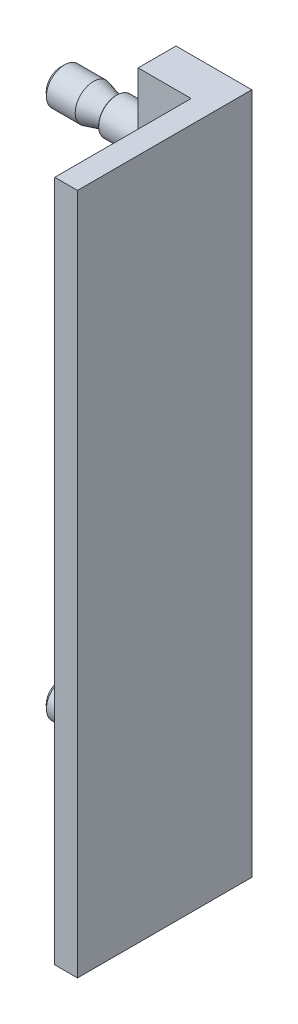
ISO-10303-21;
HEADER;
FILE_DESCRIPTION(('STEP AP214'),'2;1');
FILE_NAME('part.step','',(''),(''),'','','');
FILE_SCHEMA(('AUTOMOTIVE_DESIGN { 1 0 10303 214 1 1 1 1 }'));
ENDSEC;
DATA;
#1=APPLICATION_CONTEXT('core data for automotive mechanical design processes');
#2=APPLICATION_PROTOCOL_DEFINITION('international standard','automotive_design',2000,#1);
#3=PRODUCT_CONTEXT('',#1,'mechanical');
#4=PRODUCT('Part','Part','',(#3));
#5=PRODUCT_RELATED_PRODUCT_CATEGORY('part','',(#4));
#6=PRODUCT_DEFINITION_FORMATION('','',#4);
#7=PRODUCT_DEFINITION_CONTEXT('part definition',#1,'design');
#8=PRODUCT_DEFINITION('design','',#6,#7);
#9=PRODUCT_DEFINITION_SHAPE('','',#8);
#10=(LENGTH_UNIT() NAMED_UNIT(*) SI_UNIT(.MILLI.,.METRE.));
#11=(NAMED_UNIT(*) PLANE_ANGLE_UNIT() SI_UNIT($,.RADIAN.));
#12=(NAMED_UNIT(*) SI_UNIT($,.STERADIAN.) SOLID_ANGLE_UNIT());
#13=UNCERTAINTY_MEASURE_WITH_UNIT(LENGTH_MEASURE(1.E-05),#10,'distance_accuracy_value','');
#14=(GEOMETRIC_REPRESENTATION_CONTEXT(3) GLOBAL_UNCERTAINTY_ASSIGNED_CONTEXT((#13)) GLOBAL_UNIT_ASSIGNED_CONTEXT((#10,
#11,#12)) REPRESENTATION_CONTEXT('',''));
#15=CARTESIAN_POINT('',(0.,0.,0.));
#16=DIRECTION('',(0.,0.,1.));
#17=DIRECTION('',(1.,0.,0.));
#18=AXIS2_PLACEMENT_3D('',#15,#16,#17);
#19=CARTESIAN_POINT('',(-23.6849023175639,35.,1.90021068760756));
#20=DIRECTION('',(1.,0.,0.));
#21=DIRECTION('',(0.,1.,0.));
#22=AXIS2_PLACEMENT_3D('',#19,#20,#21);
#23=CONICAL_SURFACE('',#22,1.34162516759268,0.991977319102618);
#24=CARTESIAN_POINT('',(-23.6849023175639,35.,1.90021068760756));
#25=DIRECTION('',(1.,0.,0.));
#26=DIRECTION('',(0.,1.,0.));
#27=AXIS2_PLACEMENT_3D('',#24,#25,#26);
#28=CIRCLE('',#27,1.34162516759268);
#29=CARTESIAN_POINT('',(-23.6849023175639,36.3416251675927,1.90021068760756));
#30=VERTEX_POINT('',#29);
#31=EDGE_CURVE('E398',#30,#30,#28,.T.);
#32=ORIENTED_EDGE('',*,*,#31,.T.);
#33=EDGE_LOOP('',(#32));
#34=FACE_BOUND('',#33,.T.);
#35=CARTESIAN_POINT('',(-20.152868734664,28.5265609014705,0.));
#36=CARTESIAN_POINT('',(-20.255414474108,28.6901191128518,0.));
#37=CARTESIAN_POINT('',(-20.3577522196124,28.8538083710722,0.));
#38=CARTESIAN_POINT('',(-20.5618747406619,29.1815403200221,0.));
#39=CARTESIAN_POINT('',(-20.6636594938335,29.3455830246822,0.));
#40=CARTESIAN_POINT('',(-20.8667241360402,29.6744131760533,0.));
#41=CARTESIAN_POINT('',(-20.9680026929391,29.8392014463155,0.));
#42=CARTESIAN_POINT('',(-21.169643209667,30.1693317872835,0.));
#43=CARTESIAN_POINT('',(-21.2700051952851,30.3346738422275,0.));
#44=CARTESIAN_POINT('',(-21.4836938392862,30.6896316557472,0.));
#45=CARTESIAN_POINT('',(-21.5968365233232,30.879358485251,0.));
#46=CARTESIAN_POINT('',(-21.8208744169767,31.2601620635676,0.));
#47=CARTESIAN_POINT('',(-21.9317694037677,31.4512389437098,0.));
#48=CARTESIAN_POINT('',(-22.1500982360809,31.8351309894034,0.));
#49=CARTESIAN_POINT('',(-22.2575353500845,32.0279442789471,0.));
#50=CARTESIAN_POINT('',(-22.4146746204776,32.3193144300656,0.));
#51=CARTESIAN_POINT('',(-22.4663812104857,32.4167887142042,0.));
#52=CARTESIAN_POINT('',(-22.5680558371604,32.6126378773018,0.));
#53=CARTESIAN_POINT('',(-22.6180239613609,32.7110127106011,0.));
#54=CARTESIAN_POINT('',(-22.7059368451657,32.8891261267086,0.));
#55=CARTESIAN_POINT('',(-22.7442897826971,32.9686627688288,0.));
#56=CARTESIAN_POINT('',(-22.8191685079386,33.128597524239,0.));
#57=CARTESIAN_POINT('',(-22.8556942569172,33.2089956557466,0.));
#58=CARTESIAN_POINT('',(-22.926473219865,33.3709076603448,0.));
#59=CARTESIAN_POINT('',(-22.9607236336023,33.4524227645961,0.));
#60=CARTESIAN_POINT('',(-23.026261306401,33.6166444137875,0.));
#61=CARTESIAN_POINT('',(-23.0575486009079,33.6993509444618,0.));
#62=CARTESIAN_POINT('',(-23.1152492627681,33.8630449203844,0.));
#63=CARTESIAN_POINT('',(-23.1417996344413,33.9439835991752,0.));
#64=CARTESIAN_POINT('',(-23.1904686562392,34.1072073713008,0.));
#65=CARTESIAN_POINT('',(-23.2125869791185,34.1894925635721,0.));
#66=CARTESIAN_POINT('',(-23.251292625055,34.3551459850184,0.));
#67=CARTESIAN_POINT('',(-23.267894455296,34.4385107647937,0.));
#68=CARTESIAN_POINT('',(-23.2946105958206,34.6062533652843,0.));
#69=CARTESIAN_POINT('',(-23.3047282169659,34.6906306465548,0.));
#70=CARTESIAN_POINT('',(-23.3175020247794,34.8570999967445,0.));
#71=CARTESIAN_POINT('',(-23.320398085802,34.9391732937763,0.));
#72=CARTESIAN_POINT('',(-23.319200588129,35.1032861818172,0.));
#73=CARTESIAN_POINT('',(-23.3151054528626,35.1853257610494,0.));
#74=CARTESIAN_POINT('',(-23.300104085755,35.3502984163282,0.));
#75=CARTESIAN_POINT('',(-23.2890731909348,35.4332199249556,0.));
#76=CARTESIAN_POINT('',(-23.2608831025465,35.5979651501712,0.));
#77=CARTESIAN_POINT('',(-23.24372561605,35.6797891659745,0.));
#78=CARTESIAN_POINT('',(-23.1904982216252,35.8989115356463,0.));
#79=CARTESIAN_POINT('',(-23.1495900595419,36.0350261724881,0.));
#80=CARTESIAN_POINT('',(-23.0575490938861,36.3038052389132,0.));
#81=CARTESIAN_POINT('',(-23.006402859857,36.4364648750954,0.));
#82=CARTESIAN_POINT('',(-22.8969138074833,36.6997303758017,0.));
#83=CARTESIAN_POINT('',(-22.8385272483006,36.8303177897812,0.));
#84=CARTESIAN_POINT('',(-22.7170731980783,37.0891883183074,0.));
#85=CARTESIAN_POINT('',(-22.6540081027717,37.2174725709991,0.));
#86=CARTESIAN_POINT('',(-22.5284514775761,37.4647652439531,0.));
#87=CARTESIAN_POINT('',(-22.4661498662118,37.5838707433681,0.));
#88=CARTESIAN_POINT('',(-22.3394113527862,37.8209571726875,0.));
#89=CARTESIAN_POINT('',(-22.2749741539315,37.9389379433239,0.));
#90=CARTESIAN_POINT('',(-22.1454323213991,38.1723618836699,0.));
#91=CARTESIAN_POINT('',(-22.0803498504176,38.2878173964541,0.));
#92=CARTESIAN_POINT('',(-21.948998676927,38.5180120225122,0.));
#93=CARTESIAN_POINT('',(-21.8827302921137,38.6327513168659,0.));
#94=CARTESIAN_POINT('',(-21.8160291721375,38.7472339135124,0.));
#95=B_SPLINE_CURVE_WITH_KNOTS('',3,(#35,#36,#37,#38,#39,#40,#41,#42,#43,#44,#45,#46,#47,#48,#49,
#50,#51,#52,#53,#54,#55,#56,#57,#58,#59,#60,#61,#62,#63,#64,#65,#66,#67,#68,#69,#70,#71,#72,#73,
#74,#75,#76,#77,#78,#79,#80,#81,#82,#83,#84,#85,#86,#87,#88,#89,#90,#91,#92,#93,#94),
.UNSPECIFIED.,.F.,.F.,(4,2,2,2,2,2,2,2,2,2,2,2,2,2,2,2,2,2,2,2,2,2,2,2,2,2,2,2,2,4),(0.,
0.5791398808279,1.15830302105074,1.73857010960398,2.31882082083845,2.98151411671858,
3.64427279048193,4.30638541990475,4.63739156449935,4.96838101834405,5.23326542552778,
5.49815544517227,5.76336564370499,6.02857266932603,6.28401860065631,6.53948338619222,
6.79427093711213,7.04892828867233,7.29500689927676,7.54114100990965,7.79183079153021,
8.04245077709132,8.46817320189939,8.89445779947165,9.32345613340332,9.75223628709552,
10.1554558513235,10.5587316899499,10.956330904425,11.3538251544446),.UNSPECIFIED.);
#96=CARTESIAN_POINT('',(-23.3077026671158,34.7332646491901,0.));
#97=VERTEX_POINT('',#96);
#98=CARTESIAN_POINT('',(-23.3077026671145,35.2667353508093,0.));
#99=VERTEX_POINT('',#98);
#100=EDGE_CURVE('E325',#97,#99,#95,.T.);
#101=ORIENTED_EDGE('',*,*,#100,.F.);
#102=CARTESIAN_POINT('',(-23.3077026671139,35.,1.90021068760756));
#103=DIRECTION('',(1.,0.,0.));
#104=DIRECTION('',(0.,1.,0.));
#105=AXIS2_PLACEMENT_3D('',#102,#103,#104);
#106=CIRCLE('',#105,1.91884038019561);
#107=EDGE_CURVE('E496',#99,#97,#106,.T.);
#108=ORIENTED_EDGE('',*,*,#107,.F.);
#109=EDGE_LOOP('',(#101,#108));
#110=FACE_BOUND('',#109,.T.);
#111=ADVANCED_FACE('F14',(#34,#110),#23,.T.);
#112=CARTESIAN_POINT('',(-23.3077026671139,35.,1.90021068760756));
#113=DIRECTION('',(1.,0.,0.));
#114=DIRECTION('',(0.,1.,0.));
#115=AXIS2_PLACEMENT_3D('',#112,#113,#114);
#116=CONICAL_SURFACE('',#115,1.91884038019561,0.760039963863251);
#117=CARTESIAN_POINT('',(-20.8439244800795,31.1864695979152,0.));
#118=CARTESIAN_POINT('',(-20.9254014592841,31.2730101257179,0.));
#119=CARTESIAN_POINT('',(-21.0065992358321,31.3598158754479,0.));
#120=CARTESIAN_POINT('',(-21.1682882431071,31.5340976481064,0.));
#121=CARTESIAN_POINT('',(-21.2487794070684,31.6215737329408,0.));
#122=CARTESIAN_POINT('',(-21.4091963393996,31.7976541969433,0.));
#123=CARTESIAN_POINT('',(-21.4891187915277,31.886261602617,0.));
#124=CARTESIAN_POINT('',(-21.6478598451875,32.0644545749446,0.));
#125=CARTESIAN_POINT('',(-21.7266784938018,32.1540400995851,0.));
#126=CARTESIAN_POINT('',(-21.8871966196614,32.3393719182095,0.));
#127=CARTESIAN_POINT('',(-21.9688171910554,32.4351867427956,0.));
#128=CARTESIAN_POINT('',(-22.1299954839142,32.6285344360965,0.));
#129=CARTESIAN_POINT('',(-22.2095533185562,32.7260672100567,0.));
#130=CARTESIAN_POINT('',(-22.3657520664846,32.9232069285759,0.));
#131=CARTESIAN_POINT('',(-22.4423972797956,33.0228104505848,0.));
#132=CARTESIAN_POINT('',(-22.5917759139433,33.2248944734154,0.));
#133=CARTESIAN_POINT('',(-22.6645105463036,33.3273740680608,0.));
#134=CARTESIAN_POINT('',(-22.7835845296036,33.5052016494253,0.));
#135=CARTESIAN_POINT('',(-22.8313561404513,33.5795855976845,0.));
#136=CARTESIAN_POINT('',(-22.9231846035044,33.7306698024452,0.));
#137=CARTESIAN_POINT('',(-22.9672400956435,33.8073708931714,0.));
#138=CARTESIAN_POINT('',(-23.0500229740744,33.9629041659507,0.));
#139=CARTESIAN_POINT('',(-23.0887877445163,34.0417161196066,0.));
#140=CARTESIAN_POINT('',(-23.1596307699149,34.2022432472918,0.));
#141=CARTESIAN_POINT('',(-23.1917140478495,34.2839561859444,0.));
#142=CARTESIAN_POINT('',(-23.2542816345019,34.4723128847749,0.));
#143=CARTESIAN_POINT('',(-23.28215046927,34.5798850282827,0.));
#144=CARTESIAN_POINT('',(-23.3099544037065,34.7434003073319,0.));
#145=CARTESIAN_POINT('',(-23.316889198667,34.7981872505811,0.));
#146=CARTESIAN_POINT('',(-23.3257982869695,34.908175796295,0.));
#147=CARTESIAN_POINT('',(-23.3277727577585,34.9633773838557,0.));
#148=CARTESIAN_POINT('',(-23.3266392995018,35.0738599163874,0.));
#149=CARTESIAN_POINT('',(-23.3235189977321,35.1291407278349,0.));
#150=CARTESIAN_POINT('',(-23.3123501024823,35.2391974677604,0.));
#151=CARTESIAN_POINT('',(-23.3043012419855,35.2939733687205,0.));
#152=CARTESIAN_POINT('',(-23.2836509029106,35.4028484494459,0.));
#153=CARTESIAN_POINT('',(-23.2710335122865,35.4569445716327,0.));
#154=CARTESIAN_POINT('',(-23.2418034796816,35.5640343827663,0.));
#155=CARTESIAN_POINT('',(-23.2251904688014,35.6170279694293,0.));
#156=CARTESIAN_POINT('',(-23.1677524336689,35.7813574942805,0.));
#157=CARTESIAN_POINT('',(-23.1208628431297,35.8905765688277,0.));
#158=CARTESIAN_POINT('',(-23.0165930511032,36.1038986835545,0.));
#159=CARTESIAN_POINT('',(-22.9591940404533,36.2079921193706,0.));
#160=CARTESIAN_POINT('',(-22.8365193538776,36.4134254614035,0.));
#161=CARTESIAN_POINT('',(-22.7711418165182,36.5147038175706,0.));
#162=CARTESIAN_POINT('',(-22.6694234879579,36.6640273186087,0.));
#163=CARTESIAN_POINT('',(-22.6349227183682,36.7133509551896,0.));
#164=CARTESIAN_POINT('',(-22.564883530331,36.8112544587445,0.));
#165=CARTESIAN_POINT('',(-22.5293451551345,36.8598343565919,0.));
#166=CARTESIAN_POINT('',(-22.41058610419,37.0191562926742,0.));
#167=CARTESIAN_POINT('',(-22.3255062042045,37.1285116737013,0.));
#168=CARTESIAN_POINT('',(-22.1521766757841,37.344689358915,0.));
#169=CARTESIAN_POINT('',(-22.063926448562,37.4515111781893,0.));
#170=CARTESIAN_POINT('',(-21.885094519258,37.6632835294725,0.));
#171=CARTESIAN_POINT('',(-21.7945115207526,37.7682329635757,0.));
#172=CARTESIAN_POINT('',(-21.6116430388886,37.9766406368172,0.));
#173=CARTESIAN_POINT('',(-21.519357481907,38.0800988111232,0.));
#174=CARTESIAN_POINT('',(-21.2400903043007,38.3892775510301,0.));
#175=CARTESIAN_POINT('',(-21.0511740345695,38.5932483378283,0.));
#176=CARTESIAN_POINT('',(-20.6702550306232,38.9981339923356,0.));
#177=CARTESIAN_POINT('',(-20.4782533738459,39.1990498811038,0.));
#178=CARTESIAN_POINT('',(-20.1157611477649,39.5743776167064,0.));
#179=CARTESIAN_POINT('',(-19.9455133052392,39.7490242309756,0.));
#180=CARTESIAN_POINT('',(-19.6038147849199,40.0971704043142,0.));
#181=CARTESIAN_POINT('',(-19.4323639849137,40.2706698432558,0.));
#182=CARTESIAN_POINT('',(-19.089430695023,40.6159275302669,0.));
#183=CARTESIAN_POINT('',(-18.9179525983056,40.7876901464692,0.));
#184=CARTESIAN_POINT('',(-18.5743300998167,41.1305054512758,0.));
#185=CARTESIAN_POINT('',(-18.4021857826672,41.3015582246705,0.));
#186=CARTESIAN_POINT('',(-18.2297927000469,41.472358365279,0.));
#187=B_SPLINE_CURVE_WITH_KNOTS('',3,(#117,#118,#119,#120,#121,#122,#123,#124,#125,#126,#127,
#128,#129,#130,#131,#132,#133,#134,#135,#136,#137,#138,#139,#140,#141,#142,#143,#144,#145,#146,
#147,#148,#149,#150,#151,#152,#153,#154,#155,#156,#157,#158,#159,#160,#161,#162,#163,#164,#165,
#166,#167,#168,#169,#170,#171,#172,#173,#174,#175,#176,#177,#178,#179,#180,#181,#182,#183,#184,
#185,#186),.UNSPECIFIED.,.F.,.F.,(4,2,2,2,2,2,2,2,2,2,2,2,2,2,2,2,2,2,2,2,2,2,2,2,2,2,2,2,2,2,2,
2,2,2,4),(0.,0.356582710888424,0.713198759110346,1.07117159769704,1.42912912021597,
1.80670766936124,2.18426545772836,2.56124228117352,2.93810163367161,3.20322948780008,
3.46845395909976,3.73169484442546,3.99473711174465,4.32661381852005,4.49209268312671,
4.65756562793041,4.82344102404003,4.98932540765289,5.15579320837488,5.32227638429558,
5.67789990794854,6.03416624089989,6.39558226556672,6.57615103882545,6.75671229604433,
7.1722770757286,7.58792076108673,8.00380064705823,8.41969855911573,9.25368457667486,
10.0873854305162,10.8190687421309,11.5508274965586,12.2789491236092,13.006981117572),.UNSPECIFIED.);
#188=CARTESIAN_POINT('',(-22.8013790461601,33.5337970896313,0.));
#189=VERTEX_POINT('',#188);
#190=EDGE_CURVE('E324',#189,#97,#187,.T.);
#191=ORIENTED_EDGE('',*,*,#190,.F.);
#192=CARTESIAN_POINT('',(-22.8013790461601,35.,1.90021068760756));
#193=DIRECTION('',(1.,0.,0.));
#194=DIRECTION('',(0.,1.,0.));
#195=AXIS2_PLACEMENT_3D('',#192,#193,#194);
#196=CIRCLE('',#195,2.4001149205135);
#197=CARTESIAN_POINT('',(-22.8013790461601,36.4662029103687,0.));
#198=VERTEX_POINT('',#197);
#199=EDGE_CURVE('E493',#198,#189,#196,.T.);
#200=ORIENTED_EDGE('',*,*,#199,.F.);
#201=EDGE_CURVE('E317',#99,#198,#187,.T.);
#202=ORIENTED_EDGE('',*,*,#201,.F.);
#203=ORIENTED_EDGE('',*,*,#107,.T.);
#204=EDGE_LOOP('',(#191,#200,#202,#203));
#205=FACE_BOUND('',#204,.T.);
#206=ADVANCED_FACE('F332',(#205),#116,.T.);
#207=CARTESIAN_POINT('',(-10.0009576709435,35.,1.90021068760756));
#208=DIRECTION('',(1.,0.,0.));
#209=DIRECTION('',(0.,1.,0.));
#210=AXIS2_PLACEMENT_3D('',#207,#208,#209);
#211=CYLINDRICAL_SURFACE('',#210,2.4001149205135);
#212=DIRECTION('',(1.,0.,0.));
#213=VECTOR('',#212,1.);
#214=CARTESIAN_POINT('',(-10.0009576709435,36.4662029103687,0.));
#215=LINE('',#214,#213);
#216=CARTESIAN_POINT('',(-19.0015322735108,36.4662029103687,0.));
#217=VERTEX_POINT('',#216);
#218=EDGE_CURVE('E35',#198,#217,#215,.T.);
#219=ORIENTED_EDGE('',*,*,#218,.F.);
#220=ORIENTED_EDGE('',*,*,#199,.T.);
#221=DIRECTION('',(1.,0.,0.));
#222=VECTOR('',#221,1.);
#223=CARTESIAN_POINT('',(-10.0009576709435,33.5337970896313,0.));
#224=LINE('',#223,#222);
#225=CARTESIAN_POINT('',(-19.0015322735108,33.5337970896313,0.));
#226=VERTEX_POINT('',#225);
#227=EDGE_CURVE('E449',#226,#189,#224,.F.);
#228=ORIENTED_EDGE('',*,*,#227,.F.);
#229=CARTESIAN_POINT('',(-19.0015322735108,35.,1.90021068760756));
#230=DIRECTION('',(1.,0.,0.));
#231=DIRECTION('',(0.,1.,0.));
#232=AXIS2_PLACEMENT_3D('',#229,#230,#231);
#233=CIRCLE('',#232,2.4001149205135);
#234=EDGE_CURVE('E490',#217,#226,#233,.T.);
#235=ORIENTED_EDGE('',*,*,#234,.F.);
#236=EDGE_LOOP('',(#219,#220,#228,#235));
#237=FACE_BOUND('',#236,.T.);
#238=ADVANCED_FACE('F336',(#237),#211,.T.);
#239=CARTESIAN_POINT('',(-19.0015322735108,35.,1.90021068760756));
#240=DIRECTION('',(-1.,0.,0.));
#241=DIRECTION('',(0.,-1.,0.));
#242=AXIS2_PLACEMENT_3D('',#239,#240,#241);
#243=CONICAL_SURFACE('',#242,2.4001149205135,0.261760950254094);
#244=CARTESIAN_POINT('',(-16.3784715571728,35.,1.90021068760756));
#245=DIRECTION('',(1.,0.,0.));
#246=DIRECTION('',(0.,1.,0.));
#247=AXIS2_PLACEMENT_3D('',#244,#245,#246);
#248=CIRCLE('',#247,1.69737598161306);
#249=CARTESIAN_POINT('',(-16.3784715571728,36.6973759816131,1.90021068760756));
#250=VERTEX_POINT('',#249);
#251=EDGE_CURVE('E487',#250,#250,#248,.T.);
#252=ORIENTED_EDGE('',*,*,#251,.F.);
#253=EDGE_LOOP('',(#252));
#254=FACE_BOUND('',#253,.T.);
#255=CARTESIAN_POINT('',(-21.9498762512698,32.4377161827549,0.));
#256=CARTESIAN_POINT('',(-21.8062573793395,32.48562775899,0.));
#257=CARTESIAN_POINT('',(-21.6627751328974,32.5339535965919,0.));
#258=CARTESIAN_POINT('',(-21.3761477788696,32.6316250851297,0.));
#259=CARTESIAN_POINT('',(-21.233002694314,32.680970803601,0.));
#260=CARTESIAN_POINT('',(-20.9467982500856,32.7809838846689,0.));
#261=CARTESIAN_POINT('',(-20.8037398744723,32.8316540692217,0.));
#262=CARTESIAN_POINT('',(-20.518156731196,32.9344652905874,0.));
#263=CARTESIAN_POINT('',(-20.3756319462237,32.9866062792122,0.));
#264=CARTESIAN_POINT('',(-20.0913111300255,33.0926896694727,0.));
#265=CARTESIAN_POINT('',(-19.9495148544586,33.1466314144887,0.));
#266=CARTESIAN_POINT('',(-19.6668194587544,33.2568144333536,0.));
#267=CARTESIAN_POINT('',(-19.5259203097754,33.3130556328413,0.));
#268=CARTESIAN_POINT('',(-19.2454807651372,33.4284834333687,0.));
#269=CARTESIAN_POINT('',(-19.1059392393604,33.4876672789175,0.));
#270=CARTESIAN_POINT('',(-18.8286407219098,33.6100585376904,0.));
#271=CARTESIAN_POINT('',(-18.6908833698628,33.6732651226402,0.));
#272=CARTESIAN_POINT('',(-18.502869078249,33.764387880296,0.));
#273=CARTESIAN_POINT('',(-18.4514168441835,33.7898352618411,0.));
#274=CARTESIAN_POINT('',(-18.3490065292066,33.8417108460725,0.));
#275=CARTESIAN_POINT('',(-18.2980484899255,33.8681391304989,0.));
#276=CARTESIAN_POINT('',(-18.1457640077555,33.9492876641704,0.));
#277=CARTESIAN_POINT('',(-18.0453268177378,34.005728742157,0.));
#278=CARTESIAN_POINT('',(-17.8979844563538,34.0951935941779,0.));
#279=CARTESIAN_POINT('',(-17.8495623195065,34.125717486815,0.));
#280=CARTESIAN_POINT('',(-17.7540768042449,34.1888121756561,0.));
#281=CARTESIAN_POINT('',(-17.7070130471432,34.2213823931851,0.));
#282=CARTESIAN_POINT('',(-17.6149422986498,34.2889782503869,0.));
#283=CARTESIAN_POINT('',(-17.569928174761,34.323994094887,0.));
#284=CARTESIAN_POINT('',(-17.4826710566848,34.3972933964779,0.));
#285=CARTESIAN_POINT('',(-17.4404248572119,34.4355729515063,0.));
#286=CARTESIAN_POINT('',(-17.3716198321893,34.5049212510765,0.));
#287=CARTESIAN_POINT('',(-17.3440170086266,34.5349437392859,0.));
#288=CARTESIAN_POINT('',(-17.2918987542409,34.5976912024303,0.));
#289=CARTESIAN_POINT('',(-17.2673883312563,34.630420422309,0.));
#290=CARTESIAN_POINT('',(-17.2226371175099,34.699407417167,0.));
#291=CARTESIAN_POINT('',(-17.2024603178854,34.7357078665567,0.));
#292=CARTESIAN_POINT('',(-17.1690802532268,34.8113664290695,0.));
#293=CARTESIAN_POINT('',(-17.1558486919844,34.8507113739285,0.));
#294=CARTESIAN_POINT('',(-17.1410774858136,34.9198153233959,0.));
#295=CARTESIAN_POINT('',(-17.137272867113,34.949087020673,0.));
#296=CARTESIAN_POINT('',(-17.1347922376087,35.0078574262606,0.));
#297=CARTESIAN_POINT('',(-17.1361158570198,35.03735611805,0.));
#298=CARTESIAN_POINT('',(-17.1437164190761,35.0955935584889,0.));
#299=CARTESIAN_POINT('',(-17.1499779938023,35.1243343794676,0.));
#300=CARTESIAN_POINT('',(-17.1667447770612,35.1805268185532,0.));
#301=CARTESIAN_POINT('',(-17.1772522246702,35.2079777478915,0.));
#302=CARTESIAN_POINT('',(-17.209496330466,35.2784775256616,0.));
#303=CARTESIAN_POINT('',(-17.2341080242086,35.3201972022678,0.));
#304=CARTESIAN_POINT('',(-17.2892193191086,35.3995735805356,0.));
#305=CARTESIAN_POINT('',(-17.3197421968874,35.4372132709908,0.));
#306=CARTESIAN_POINT('',(-17.3964765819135,35.5223080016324,0.));
#307=CARTESIAN_POINT('',(-17.4443232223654,35.5682652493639,0.));
#308=CARTESIAN_POINT('',(-17.5441500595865,35.6555100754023,0.));
#309=CARTESIAN_POINT('',(-17.596139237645,35.6967870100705,0.));
#310=CARTESIAN_POINT('',(-17.7033755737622,35.7762983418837,0.));
#311=CARTESIAN_POINT('',(-17.7586552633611,35.8144884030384,0.));
#312=CARTESIAN_POINT('',(-17.870938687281,35.8880613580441,0.));
#313=CARTESIAN_POINT('',(-17.927940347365,35.9234474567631,0.));
#314=CARTESIAN_POINT('',(-18.0530263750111,35.9979044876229,0.));
#315=CARTESIAN_POINT('',(-18.1213461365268,36.0365778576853,0.));
#316=CARTESIAN_POINT('',(-18.259233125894,36.1116425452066,0.));
#317=CARTESIAN_POINT('',(-18.3288005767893,36.1480334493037,0.));
#318=CARTESIAN_POINT('',(-18.5389578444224,36.254548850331,0.));
#319=CARTESIAN_POINT('',(-18.6809164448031,36.3219666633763,0.));
#320=CARTESIAN_POINT('',(-18.9675191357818,36.4521837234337,0.));
#321=CARTESIAN_POINT('',(-19.1121711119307,36.514965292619,0.));
#322=CARTESIAN_POINT('',(-19.4028969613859,36.6369726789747,0.));
#323=CARTESIAN_POINT('',(-19.5489702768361,36.6961998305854,0.));
#324=CARTESIAN_POINT('',(-19.8250286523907,36.8052321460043,0.));
#325=CARTESIAN_POINT('',(-19.9548990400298,36.8553295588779,0.));
#326=CARTESIAN_POINT('',(-20.2152820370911,36.953869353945,0.));
#327=CARTESIAN_POINT('',(-20.345794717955,37.0023115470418,0.));
#328=CARTESIAN_POINT('',(-20.606378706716,37.097502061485,0.));
#329=CARTESIAN_POINT('',(-20.7364465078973,37.1442600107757,0.));
#330=CARTESIAN_POINT('',(-20.9969575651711,37.236648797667,0.));
#331=CARTESIAN_POINT('',(-21.1274007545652,37.2822798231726,0.));
#332=CARTESIAN_POINT('',(-21.2579983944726,37.3274583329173,0.));
#333=B_SPLINE_CURVE_WITH_KNOTS('',3,(#255,#256,#257,#258,#259,#260,#261,#262,#263,#264,#265,
#266,#267,#268,#269,#270,#271,#272,#273,#274,#275,#276,#277,#278,#279,#280,#281,#282,#283,#284,
#285,#286,#287,#288,#289,#290,#291,#292,#293,#294,#295,#296,#297,#298,#299,#300,#301,#302,#303,
#304,#305,#306,#307,#308,#309,#310,#311,#312,#313,#314,#315,#316,#317,#318,#319,#320,#321,#322,
#323,#324,#325,#326,#327,#328,#329,#330,#331,#332),.UNSPECIFIED.,.F.,.F.,(4,2,2,2,2,2,2,2,2,2,2,
2,2,2,2,2,2,2,2,2,2,2,2,2,2,2,2,2,2,2,2,2,2,2,2,2,2,2,4),(0.,0.454201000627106,
0.908432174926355,1.36372604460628,1.81900501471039,2.27411974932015,2.72921977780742,
3.1839013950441,3.63848969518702,3.81068310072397,3.98289088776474,4.32830172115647,
4.49998452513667,4.67161899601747,4.84260162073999,5.01338261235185,5.13558373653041,
5.25798028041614,5.38207585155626,5.50566183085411,5.59380081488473,5.68193344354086,
5.76979286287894,5.85769867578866,6.00216838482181,6.1472189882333,6.34574962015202,
6.54472304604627,6.74617654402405,6.94739636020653,7.18285547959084,7.41835711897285,
7.88965781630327,8.36267155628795,8.83550658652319,9.25308792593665,9.67071681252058,
10.0853624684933,10.4999385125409),.UNSPECIFIED.);
#334=EDGE_CURVE('E309',#217,#226,#333,.F.);
#335=ORIENTED_EDGE('',*,*,#334,.F.);
#336=ORIENTED_EDGE('',*,*,#234,.T.);
#337=EDGE_LOOP('',(#335,#336));
#338=FACE_BOUND('',#337,.T.);
#339=ADVANCED_FACE('F514',(#254,#338),#243,.T.);
#340=CARTESIAN_POINT('',(-16.0245522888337,35.,1.90021068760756));
#341=DIRECTION('',(1.,0.,0.));
#342=DIRECTION('',(0.,1.,0.));
#343=AXIS2_PLACEMENT_3D('',#340,#341,#342);
#344=CONICAL_SURFACE('',#343,1.87029544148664,1.37127084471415);
#345=CARTESIAN_POINT('',(-16.0245522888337,35.,1.90021068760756));
#346=DIRECTION('',(1.,0.,0.));
#347=DIRECTION('',(0.,1.,0.));
#348=AXIS2_PLACEMENT_3D('',#345,#346,#347);
#349=CIRCLE('',#348,1.87029544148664);
#350=CARTESIAN_POINT('',(-16.0245522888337,36.8702954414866,1.90021068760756));
#351=VERTEX_POINT('',#350);
#352=EDGE_CURVE('E475',#351,#351,#349,.T.);
#353=ORIENTED_EDGE('',*,*,#352,.T.);
#354=EDGE_LOOP('',(#353));
#355=FACE_BOUND('',#354,.T.);
#356=CARTESIAN_POINT('',(-15.7201400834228,32.2099480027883,0.));
#357=CARTESIAN_POINT('',(-15.7343598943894,32.2950421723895,0.));
#358=CARTESIAN_POINT('',(-15.7483842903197,32.3801690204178,0.));
#359=CARTESIAN_POINT('',(-15.7759446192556,32.5505041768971,0.));
#360=CARTESIAN_POINT('',(-15.7894805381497,32.6357124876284,0.));
#361=CARTESIAN_POINT('',(-15.8292313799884,32.8916275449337,0.));
#362=CARTESIAN_POINT('',(-15.8545638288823,33.0624735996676,0.));
#363=CARTESIAN_POINT('',(-15.9015215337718,33.4035386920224,0.));
#364=CARTESIAN_POINT('',(-15.9231700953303,33.5737544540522,0.));
#365=CARTESIAN_POINT('',(-15.9611839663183,33.914731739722,0.));
#366=CARTESIAN_POINT('',(-15.9775511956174,34.0854930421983,0.));
#367=CARTESIAN_POINT('',(-16.0027913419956,34.4284506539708,0.));
#368=CARTESIAN_POINT('',(-16.0116272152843,34.6006498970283,0.));
#369=CARTESIAN_POINT('',(-16.0178415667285,34.8591285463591,0.));
#370=CARTESIAN_POINT('',(-16.0187394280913,34.9453294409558,0.));
#371=CARTESIAN_POINT('',(-16.0181607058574,35.1177216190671,0.));
#372=CARTESIAN_POINT('',(-16.0166841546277,35.2039129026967,0.));
#373=CARTESIAN_POINT('',(-16.0087557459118,35.4634004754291,0.));
#374=CARTESIAN_POINT('',(-15.9987815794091,35.6365967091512,0.));
#375=CARTESIAN_POINT('',(-15.9782446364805,35.8959188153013,0.));
#376=CARTESIAN_POINT('',(-15.9704687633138,35.9822885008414,0.));
#377=CARTESIAN_POINT('',(-15.953358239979,36.1548576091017,0.));
#378=CARTESIAN_POINT('',(-15.944023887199,36.2410570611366,0.));
#379=CARTESIAN_POINT('',(-15.9340587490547,36.3271840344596,0.));
#380=B_SPLINE_CURVE_WITH_KNOTS('',3,(#356,#357,#358,#359,#360,#361,#362,#363,#364,#365,#366,
#367,#368,#369,#370,#371,#372,#373,#374,#375,#376,#377,#378,#379),.UNSPECIFIED.,.F.,.F.,(4,2,2,
2,2,2,2,2,2,2,2,4),(0.,0.258821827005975,0.51765112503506,1.03576859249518,1.55047545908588,
2.06499500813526,2.58203090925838,2.84061707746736,3.09919972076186,3.61940295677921,
3.87955103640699,4.13964953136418),.UNSPECIFIED.);
#381=CARTESIAN_POINT('',(-16.0009576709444,34.4192490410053,0.));
#382=VERTEX_POINT('',#381);
#383=CARTESIAN_POINT('',(-16.0009576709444,35.5807509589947,0.));
#384=VERTEX_POINT('',#383);
#385=EDGE_CURVE('E287',#382,#384,#380,.T.);
#386=ORIENTED_EDGE('',*,*,#385,.F.);
#387=CARTESIAN_POINT('',(-16.0009576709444,35.,1.90021068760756));
#388=DIRECTION('',(1.,0.,0.));
#389=DIRECTION('',(0.,1.,0.));
#390=AXIS2_PLACEMENT_3D('',#387,#388,#389);
#391=CIRCLE('',#390,1.98697567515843);
#392=EDGE_CURVE('E468',#384,#382,#391,.T.);
#393=ORIENTED_EDGE('',*,*,#392,.F.);
#394=EDGE_LOOP('',(#386,#393));
#395=FACE_BOUND('',#394,.T.);
#396=ADVANCED_FACE('F516',(#355,#395),#344,.T.);
#397=CARTESIAN_POINT('',(-16.0009576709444,35.,3.88718636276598));
#398=DIRECTION('',(1.,0.,0.));
#399=DIRECTION('',(0.,1.,0.));
#400=AXIS2_PLACEMENT_3D('',#397,#398,#399);
#401=PLANE('',#400);
#402=DIRECTION('',(0.,1.,0.));
#403=VECTOR('',#402,1.);
#404=CARTESIAN_POINT('',(-16.0009576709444,35.,0.));
#405=LINE('',#404,#403);
#406=CARTESIAN_POINT('',(-16.0009576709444,33.7039228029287,0.));
#407=VERTEX_POINT('',#406);
#408=EDGE_CURVE('E451',#407,#382,#405,.T.);
#409=ORIENTED_EDGE('',*,*,#408,.F.);
#410=CARTESIAN_POINT('',(-16.0009576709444,35.,1.90021068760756));
#411=DIRECTION('',(1.,0.,0.));
#412=DIRECTION('',(0.,1.,0.));
#413=AXIS2_PLACEMENT_3D('',#410,#411,#412);
#414=CIRCLE('',#413,2.30013407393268);
#415=CARTESIAN_POINT('',(-16.0009576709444,36.2960771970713,0.));
#416=VERTEX_POINT('',#415);
#417=EDGE_CURVE('E466',#416,#407,#414,.T.);
#418=ORIENTED_EDGE('',*,*,#417,.F.);
#419=EDGE_CURVE('E453',#384,#416,#405,.T.);
#420=ORIENTED_EDGE('',*,*,#419,.F.);
#421=ORIENTED_EDGE('',*,*,#392,.T.);
#422=EDGE_LOOP('',(#409,#418,#420,#421));
#423=FACE_BOUND('',#422,.T.);
#424=ADVANCED_FACE('F523',(#423),#401,.F.);
#425=CARTESIAN_POINT('',(-16.0009576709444,35.,1.90021068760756));
#426=DIRECTION('',(1.,0.,0.));
#427=DIRECTION('',(0.,1.,0.));
#428=AXIS2_PLACEMENT_3D('',#425,#426,#427);
#429=CONICAL_SURFACE('',#428,2.30013407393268,0.785398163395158);
#430=CARTESIAN_POINT('',(-13.8849515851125,31.0135864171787,0.));
#431=CARTESIAN_POINT('',(-13.9688770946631,31.106572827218,0.));
#432=CARTESIAN_POINT('',(-14.052517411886,31.1998189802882,0.));
#433=CARTESIAN_POINT('',(-14.2190693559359,31.3869739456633,0.));
#434=CARTESIAN_POINT('',(-14.3019809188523,31.4808828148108,0.));
#435=CARTESIAN_POINT('',(-14.4671066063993,31.6697238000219,0.));
#436=CARTESIAN_POINT('',(-14.5493184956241,31.764657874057,0.));
#437=CARTESIAN_POINT('',(-14.712594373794,31.9555037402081,0.));
#438=CARTESIAN_POINT('',(-14.7936584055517,32.0514154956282,0.));
#439=CARTESIAN_POINT('',(-14.9528778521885,32.2427368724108,0.));
#440=CARTESIAN_POINT('',(-15.031059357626,32.3381247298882,0.));
#441=CARTESIAN_POINT('',(-15.1855668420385,32.5303901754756,0.));
#442=CARTESIAN_POINT('',(-15.2618929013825,32.6272676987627,0.));
#443=CARTESIAN_POINT('',(-15.41202266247,32.8228797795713,0.));
#444=CARTESIAN_POINT('',(-15.485827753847,32.9216132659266,0.));
#445=CARTESIAN_POINT('',(-15.6300199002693,33.121534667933,0.));
#446=CARTESIAN_POINT('',(-15.7004076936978,33.2227220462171,0.));
#447=CARTESIAN_POINT('',(-15.8228419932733,33.4079152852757,0.));
#448=CARTESIAN_POINT('',(-15.875755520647,33.4913439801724,0.));
#449=CARTESIAN_POINT('',(-15.9772989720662,33.660670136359,0.));
#450=CARTESIAN_POINT('',(-16.0259333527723,33.746564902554,0.));
#451=CARTESIAN_POINT('',(-16.1177163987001,33.9220576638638,0.));
#452=CARTESIAN_POINT('',(-16.1608251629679,34.0116770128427,0.));
#453=CARTESIAN_POINT('',(-16.2193958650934,34.1489010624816,0.));
#454=CARTESIAN_POINT('',(-16.2379314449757,34.1951928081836,0.));
#455=CARTESIAN_POINT('',(-16.2725833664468,34.2887102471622,0.));
#456=CARTESIAN_POINT('',(-16.2886978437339,34.3359366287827,0.));
#457=CARTESIAN_POINT('',(-16.3034118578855,34.383620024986,0.));
#458=B_SPLINE_CURVE_WITH_KNOTS('',3,(#430,#431,#432,#433,#434,#435,#436,#437,#438,#439,#440,
#441,#442,#443,#444,#445,#446,#447,#448,#449,#450,#451,#452,#453,#454,#455,#456,#457),
.UNSPECIFIED.,.F.,.F.,(4,2,2,2,2,2,2,2,2,2,2,2,2,4),(0.,0.375780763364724,0.751594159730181,
1.1283381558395,1.50506806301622,1.87505180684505,2.24501949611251,2.61477984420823,
2.98445993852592,3.28074749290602,3.57672272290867,3.87472739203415,4.02426084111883,
4.17390885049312),.UNSPECIFIED.);
#459=CARTESIAN_POINT('',(-15.9009768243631,33.5337970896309,0.));
#460=VERTEX_POINT('',#459);
#461=EDGE_CURVE('E295',#460,#407,#458,.T.);
#462=ORIENTED_EDGE('',*,*,#461,.F.);
#463=CARTESIAN_POINT('',(-15.9009768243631,35.,1.90021068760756));
#464=DIRECTION('',(1.,0.,0.));
#465=DIRECTION('',(0.,1.,0.));
#466=AXIS2_PLACEMENT_3D('',#463,#464,#465);
#467=CIRCLE('',#466,2.4001149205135);
#468=CARTESIAN_POINT('',(-15.9009768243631,36.4662029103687,0.));
#469=VERTEX_POINT('',#468);
#470=EDGE_CURVE('E464',#469,#460,#467,.T.);
#471=ORIENTED_EDGE('',*,*,#470,.F.);
#472=CARTESIAN_POINT('',(-16.3034118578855,35.616379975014,0.));
#473=CARTESIAN_POINT('',(-16.2886978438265,35.6640633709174,0.));
#474=CARTESIAN_POINT('',(-16.2725833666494,35.7112897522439,0.));
#475=CARTESIAN_POINT('',(-16.2379314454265,35.8048071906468,0.));
#476=CARTESIAN_POINT('',(-16.2193958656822,35.8510989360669,0.));
#477=CARTESIAN_POINT('',(-16.1608251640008,35.9883229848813,0.));
#478=CARTESIAN_POINT('',(-16.1177164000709,36.0779423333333,0.));
#479=CARTESIAN_POINT('',(-16.0259333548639,36.2534350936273,0.));
#480=CARTESIAN_POINT('',(-15.9772989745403,36.3393298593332,0.));
#481=CARTESIAN_POINT('',(-15.8757555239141,36.5086560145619,0.));
#482=CARTESIAN_POINT('',(-15.822841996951,36.5920847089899,0.));
#483=CARTESIAN_POINT('',(-15.7004076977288,36.7772779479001,0.));
#484=CARTESIAN_POINT('',(-15.6300199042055,36.8784653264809,0.));
#485=CARTESIAN_POINT('',(-15.485827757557,37.0783867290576,0.));
#486=CARTESIAN_POINT('',(-15.4120226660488,37.1771202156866,0.));
#487=CARTESIAN_POINT('',(-15.2618929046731,37.3727322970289,0.));
#488=CARTESIAN_POINT('',(-15.1855668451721,37.469609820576,0.));
#489=CARTESIAN_POINT('',(-15.03105936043,37.6618752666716,0.));
#490=CARTESIAN_POINT('',(-14.9528778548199,37.7572631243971,0.));
#491=CARTESIAN_POINT('',(-14.7936584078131,37.9485845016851,0.));
#492=CARTESIAN_POINT('',(-14.7125943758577,38.044496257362,0.));
#493=CARTESIAN_POINT('',(-14.5493184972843,38.2353421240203,0.));
#494=CARTESIAN_POINT('',(-14.4671066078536,38.3302761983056,0.));
#495=CARTESIAN_POINT('',(-14.3019809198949,38.5191171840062,0.));
#496=CARTESIAN_POINT('',(-14.2190693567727,38.6130260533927,0.));
#497=CARTESIAN_POINT('',(-14.0525174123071,38.8001810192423,0.));
#498=CARTESIAN_POINT('',(-13.9688770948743,38.8934271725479,0.));
#499=CARTESIAN_POINT('',(-13.8849515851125,38.9864135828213,0.));
#500=B_SPLINE_CURVE_WITH_KNOTS('',3,(#472,#473,#474,#475,#476,#477,#478,#479,#480,#481,#482,
#483,#484,#485,#486,#487,#488,#489,#490,#491,#492,#493,#494,#495,#496,#497,#498,#499),
.UNSPECIFIED.,.F.,.F.,(4,2,2,2,2,2,2,2,2,2,2,2,2,4),(0.,0.149648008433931,0.29918145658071,
0.597186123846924,0.893161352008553,1.18944890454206,1.55912899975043,1.92888934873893,
2.29885703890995,2.66884078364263,3.04557069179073,3.42231468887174,3.79812808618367,
4.17390885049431),.UNSPECIFIED.);
#501=EDGE_CURVE('E278',#416,#469,#500,.T.);
#502=ORIENTED_EDGE('',*,*,#501,.F.);
#503=ORIENTED_EDGE('',*,*,#417,.T.);
#504=EDGE_LOOP('',(#462,#471,#502,#503));
#505=FACE_BOUND('',#504,.T.);
#506=ADVANCED_FACE('F465',(#505),#429,.T.);
#507=CARTESIAN_POINT('',(-10.0009576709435,35.,1.90021068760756));
#508=DIRECTION('',(1.,0.,0.));
#509=DIRECTION('',(0.,1.,0.));
#510=AXIS2_PLACEMENT_3D('',#507,#508,#509);
#511=CYLINDRICAL_SURFACE('',#510,2.4001149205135);
#512=DIRECTION('',(1.,0.,0.));
#513=VECTOR('',#512,1.);
#514=CARTESIAN_POINT('',(-10.0009576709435,36.4662029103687,0.));
#515=LINE('',#514,#513);
#516=CARTESIAN_POINT('',(-10.1009385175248,36.4662029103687,0.));
#517=VERTEX_POINT('',#516);
#518=EDGE_CURVE('E43',#469,#517,#515,.T.);
#519=ORIENTED_EDGE('',*,*,#518,.F.);
#520=ORIENTED_EDGE('',*,*,#470,.T.);
#521=DIRECTION('',(1.,0.,0.));
#522=VECTOR('',#521,1.);
#523=CARTESIAN_POINT('',(-10.0009576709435,33.5337970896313,0.));
#524=LINE('',#523,#522);
#525=CARTESIAN_POINT('',(-10.1009385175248,33.5337970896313,0.));
#526=VERTEX_POINT('',#525);
#527=EDGE_CURVE('E448',#526,#460,#524,.F.);
#528=ORIENTED_EDGE('',*,*,#527,.F.);
#529=CARTESIAN_POINT('',(-10.1009385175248,35.,1.90021068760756));
#530=DIRECTION('',(1.,0.,0.));
#531=DIRECTION('',(0.,1.,0.));
#532=AXIS2_PLACEMENT_3D('',#529,#530,#531);
#533=CIRCLE('',#532,2.4001149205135);
#534=EDGE_CURVE('E446',#517,#526,#533,.T.);
#535=ORIENTED_EDGE('',*,*,#534,.F.);
#536=EDGE_LOOP('',(#519,#520,#528,#535));
#537=FACE_BOUND('',#536,.T.);
#538=ADVANCED_FACE('F463',(#537),#511,.T.);
#539=CARTESIAN_POINT('',(-10.1009385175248,35.,1.90021068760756));
#540=DIRECTION('',(-1.,0.,0.));
#541=DIRECTION('',(0.,-1.,0.));
#542=AXIS2_PLACEMENT_3D('',#539,#540,#541);
#543=CONICAL_SURFACE('',#542,2.4001149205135,0.785398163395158);
#544=CARTESIAN_POINT('',(-9.69850348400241,34.3836200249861,0.));
#545=CARTESIAN_POINT('',(-9.7132174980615,34.3359366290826,0.));
#546=CARTESIAN_POINT('',(-9.72933197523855,34.2887102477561,0.));
#547=CARTESIAN_POINT('',(-9.76398389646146,34.1951928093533,0.));
#548=CARTESIAN_POINT('',(-9.78251947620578,34.1489010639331,0.));
#549=CARTESIAN_POINT('',(-9.84109017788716,34.0116770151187,0.));
#550=CARTESIAN_POINT('',(-9.88419894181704,33.9220576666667,0.));
#551=CARTESIAN_POINT('',(-9.97598198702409,33.7465649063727,0.));
#552=CARTESIAN_POINT('',(-10.0246163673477,33.6606701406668,0.));
#553=CARTESIAN_POINT('',(-10.1261598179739,33.4913439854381,0.));
#554=CARTESIAN_POINT('',(-10.179073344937,33.4079152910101,0.));
#555=CARTESIAN_POINT('',(-10.3015076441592,33.2227220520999,0.));
#556=CARTESIAN_POINT('',(-10.3718954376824,33.1215346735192,0.));
#557=CARTESIAN_POINT('',(-10.5160875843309,32.9216132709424,0.));
#558=CARTESIAN_POINT('',(-10.5898926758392,32.8228797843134,0.));
#559=CARTESIAN_POINT('',(-10.7400224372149,32.6272677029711,0.));
#560=CARTESIAN_POINT('',(-10.8163484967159,32.530390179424,0.));
#561=CARTESIAN_POINT('',(-10.970855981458,32.3381247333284,0.));
#562=CARTESIAN_POINT('',(-11.0490374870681,32.2427368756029,0.));
#563=CARTESIAN_POINT('',(-11.2082569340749,32.0514154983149,0.));
#564=CARTESIAN_POINT('',(-11.2893209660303,31.955503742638,0.));
#565=CARTESIAN_POINT('',(-11.4525968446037,31.7646578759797,0.));
#566=CARTESIAN_POINT('',(-11.5348087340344,31.6697238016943,0.));
#567=CARTESIAN_POINT('',(-11.6999344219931,31.4808828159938,0.));
#568=CARTESIAN_POINT('',(-11.7828459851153,31.3869739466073,0.));
#569=CARTESIAN_POINT('',(-11.9493979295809,31.1998189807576,0.));
#570=CARTESIAN_POINT('',(-12.0330382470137,31.1065728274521,0.));
#571=CARTESIAN_POINT('',(-12.1169637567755,31.0135864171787,0.));
#572=B_SPLINE_CURVE_WITH_KNOTS('',3,(#544,#545,#546,#547,#548,#549,#550,#551,#552,#553,#554,
#555,#556,#557,#558,#559,#560,#561,#562,#563,#564,#565,#566,#567,#568,#569,#570,#571),
.UNSPECIFIED.,.F.,.F.,(4,2,2,2,2,2,2,2,2,2,2,2,2,4),(0.,0.149648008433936,0.299181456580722,
0.597186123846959,0.893161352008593,1.18944890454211,1.55912899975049,1.928889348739,
2.29885703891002,2.6688407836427,3.0455706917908,3.42231468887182,3.79812808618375,
4.17390885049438),.UNSPECIFIED.);
#573=CARTESIAN_POINT('',(-10.0009576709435,33.7039228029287,0.));
#574=VERTEX_POINT('',#573);
#575=EDGE_CURVE('E303',#574,#526,#572,.T.);
#576=ORIENTED_EDGE('',*,*,#575,.F.);
#577=CARTESIAN_POINT('',(-10.0009576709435,35.,1.90021068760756));
#578=DIRECTION('',(1.,0.,0.));
#579=DIRECTION('',(0.,1.,0.));
#580=AXIS2_PLACEMENT_3D('',#577,#578,#579);
#581=CIRCLE('',#580,2.30013407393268);
#582=CARTESIAN_POINT('',(-10.0009576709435,36.2960771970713,0.));
#583=VERTEX_POINT('',#582);
#584=EDGE_CURVE('E191',#583,#574,#581,.T.);
#585=ORIENTED_EDGE('',*,*,#584,.F.);
#586=CARTESIAN_POINT('',(-12.1169637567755,38.9864135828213,0.));
#587=CARTESIAN_POINT('',(-12.0330382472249,38.893427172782,0.));
#588=CARTESIAN_POINT('',(-11.949397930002,38.8001810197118,0.));
#589=CARTESIAN_POINT('',(-11.782845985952,38.6130260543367,0.));
#590=CARTESIAN_POINT('',(-11.6999344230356,38.5191171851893,0.));
#591=CARTESIAN_POINT('',(-11.5348087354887,38.3302761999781,0.));
#592=CARTESIAN_POINT('',(-11.4525968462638,38.235342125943,0.));
#593=CARTESIAN_POINT('',(-11.2893209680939,38.0444962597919,0.));
#594=CARTESIAN_POINT('',(-11.2082569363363,37.9485845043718,0.));
#595=CARTESIAN_POINT('',(-11.0490374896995,37.7572631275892,0.));
#596=CARTESIAN_POINT('',(-10.970855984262,37.6618752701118,0.));
#597=CARTESIAN_POINT('',(-10.8163484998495,37.4696098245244,0.));
#598=CARTESIAN_POINT('',(-10.7400224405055,37.3727323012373,0.));
#599=CARTESIAN_POINT('',(-10.589892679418,37.1771202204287,0.));
#600=CARTESIAN_POINT('',(-10.516087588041,37.0783867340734,0.));
#601=CARTESIAN_POINT('',(-10.3718954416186,36.878465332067,0.));
#602=CARTESIAN_POINT('',(-10.3015076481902,36.7772779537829,0.));
#603=CARTESIAN_POINT('',(-10.1790733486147,36.5920847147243,0.));
#604=CARTESIAN_POINT('',(-10.126159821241,36.5086560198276,0.));
#605=CARTESIAN_POINT('',(-10.0246163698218,36.339329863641,0.));
#606=CARTESIAN_POINT('',(-9.9759819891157,36.2534350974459,0.));
#607=CARTESIAN_POINT('',(-9.88419894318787,36.0779423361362,0.));
#608=CARTESIAN_POINT('',(-9.84109017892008,35.9883229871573,0.));
#609=CARTESIAN_POINT('',(-9.78251947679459,35.8510989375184,0.));
#610=CARTESIAN_POINT('',(-9.76398389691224,35.8048071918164,0.));
#611=CARTESIAN_POINT('',(-9.7293319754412,35.7112897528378,0.));
#612=CARTESIAN_POINT('',(-9.71321749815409,35.6640633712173,0.));
#613=CARTESIAN_POINT('',(-9.69850348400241,35.616379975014,0.));
#614=B_SPLINE_CURVE_WITH_KNOTS('',3,(#586,#587,#588,#589,#590,#591,#592,#593,#594,#595,#596,
#597,#598,#599,#600,#601,#602,#603,#604,#605,#606,#607,#608,#609,#610,#611,#612,#613),
.UNSPECIFIED.,.F.,.F.,(4,2,2,2,2,2,2,2,2,2,2,2,2,4),(0.,0.375780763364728,0.751594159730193,
1.12833815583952,1.50506806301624,1.87505180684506,2.24501949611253,2.61477984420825,
2.98445993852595,3.28074749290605,3.57672272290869,3.87472739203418,4.02426084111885,
4.17390885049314),.UNSPECIFIED.);
#615=EDGE_CURVE('E269',#517,#583,#614,.T.);
#616=ORIENTED_EDGE('',*,*,#615,.F.);
#617=ORIENTED_EDGE('',*,*,#534,.T.);
#618=EDGE_LOOP('',(#576,#585,#616,#617));
#619=FACE_BOUND('',#618,.T.);
#620=ADVANCED_FACE('F445',(#619),#543,.T.);
#621=CARTESIAN_POINT('',(-23.6849023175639,-35.,1.90021068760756));
#622=DIRECTION('',(1.,0.,0.));
#623=DIRECTION('',(0.,1.,0.));
#624=AXIS2_PLACEMENT_3D('',#621,#622,#623);
#625=CONICAL_SURFACE('',#624,1.34162516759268,0.991977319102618);
#626=CARTESIAN_POINT('',(-23.6849023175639,-35.,1.90021068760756));
#627=DIRECTION('',(1.,0.,0.));
#628=DIRECTION('',(0.,1.,0.));
#629=AXIS2_PLACEMENT_3D('',#626,#627,#628);
#630=CIRCLE('',#629,1.34162516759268);
#631=CARTESIAN_POINT('',(-23.6849023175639,-33.6583748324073,1.90021068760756));
#632=VERTEX_POINT('',#631);
#633=EDGE_CURVE('E653',#632,#632,#630,.T.);
#634=ORIENTED_EDGE('',*,*,#633,.T.);
#635=EDGE_LOOP('',(#634));
#636=FACE_BOUND('',#635,.T.);
#637=CARTESIAN_POINT('',(-20.152868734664,-41.4734390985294,0.));
#638=CARTESIAN_POINT('',(-20.255414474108,-41.3098808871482,0.));
#639=CARTESIAN_POINT('',(-20.3577522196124,-41.1461916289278,0.));
#640=CARTESIAN_POINT('',(-20.5618747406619,-40.8184596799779,0.));
#641=CARTESIAN_POINT('',(-20.6636594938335,-40.6544169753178,0.));
#642=CARTESIAN_POINT('',(-20.8667241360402,-40.3255868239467,0.));
#643=CARTESIAN_POINT('',(-20.9680026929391,-40.1607985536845,0.));
#644=CARTESIAN_POINT('',(-21.169643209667,-39.8306682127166,0.));
#645=CARTESIAN_POINT('',(-21.2700051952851,-39.6653261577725,0.));
#646=CARTESIAN_POINT('',(-21.4836938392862,-39.3103683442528,0.));
#647=CARTESIAN_POINT('',(-21.5968365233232,-39.120641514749,0.));
#648=CARTESIAN_POINT('',(-21.8208744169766,-38.7398379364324,0.));
#649=CARTESIAN_POINT('',(-21.9317694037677,-38.5487610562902,0.));
#650=CARTESIAN_POINT('',(-22.1500982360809,-38.1648690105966,0.));
#651=CARTESIAN_POINT('',(-22.2575353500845,-37.9720557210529,0.));
#652=CARTESIAN_POINT('',(-22.4146746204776,-37.6806855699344,0.));
#653=CARTESIAN_POINT('',(-22.4663812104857,-37.5832112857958,0.));
#654=CARTESIAN_POINT('',(-22.5680558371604,-37.3873621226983,0.));
#655=CARTESIAN_POINT('',(-22.6180239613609,-37.288987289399,0.));
#656=CARTESIAN_POINT('',(-22.7059368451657,-37.1108738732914,0.));
#657=CARTESIAN_POINT('',(-22.7442897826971,-37.0313372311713,0.));
#658=CARTESIAN_POINT('',(-22.8191685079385,-36.871402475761,0.));
#659=CARTESIAN_POINT('',(-22.8556942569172,-36.7910043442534,0.));
#660=CARTESIAN_POINT('',(-22.926473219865,-36.6290923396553,0.));
#661=CARTESIAN_POINT('',(-22.9607236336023,-36.5475772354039,0.));
#662=CARTESIAN_POINT('',(-23.026261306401,-36.3833555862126,0.));
#663=CARTESIAN_POINT('',(-23.0575486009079,-36.3006490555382,0.));
#664=CARTESIAN_POINT('',(-23.1152492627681,-36.1369550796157,0.));
#665=CARTESIAN_POINT('',(-23.1417996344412,-36.0560164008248,0.));
#666=CARTESIAN_POINT('',(-23.1904686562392,-35.8927926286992,0.));
#667=CARTESIAN_POINT('',(-23.2125869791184,-35.810507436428,0.));
#668=CARTESIAN_POINT('',(-23.251292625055,-35.6448540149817,0.));
#669=CARTESIAN_POINT('',(-23.267894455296,-35.5614892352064,0.));
#670=CARTESIAN_POINT('',(-23.2946105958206,-35.3937466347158,0.));
#671=CARTESIAN_POINT('',(-23.3047282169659,-35.3093693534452,0.));
#672=CARTESIAN_POINT('',(-23.3175020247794,-35.1429000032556,0.));
#673=CARTESIAN_POINT('',(-23.320398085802,-35.0608267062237,0.));
#674=CARTESIAN_POINT('',(-23.319200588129,-34.8967138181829,0.));
#675=CARTESIAN_POINT('',(-23.3151054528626,-34.8146742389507,0.));
#676=CARTESIAN_POINT('',(-23.300104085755,-34.6497015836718,0.));
#677=CARTESIAN_POINT('',(-23.2890731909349,-34.5667800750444,0.));
#678=CARTESIAN_POINT('',(-23.2608831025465,-34.4020348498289,0.));
#679=CARTESIAN_POINT('',(-23.24372561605,-34.3202108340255,0.));
#680=CARTESIAN_POINT('',(-23.1904982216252,-34.1010884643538,0.));
#681=CARTESIAN_POINT('',(-23.149590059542,-33.9649738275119,0.));
#682=CARTESIAN_POINT('',(-23.0575490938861,-33.6961947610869,0.));
#683=CARTESIAN_POINT('',(-23.006402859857,-33.5635351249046,0.));
#684=CARTESIAN_POINT('',(-22.8969138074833,-33.3002696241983,0.));
#685=CARTESIAN_POINT('',(-22.8385272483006,-33.1696822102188,0.));
#686=CARTESIAN_POINT('',(-22.7170731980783,-32.9108116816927,0.));
#687=CARTESIAN_POINT('',(-22.6540081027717,-32.7825274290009,0.));
#688=CARTESIAN_POINT('',(-22.5284514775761,-32.535234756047,0.));
#689=CARTESIAN_POINT('',(-22.4661498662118,-32.4161292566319,0.));
#690=CARTESIAN_POINT('',(-22.3394113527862,-32.1790428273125,0.));
#691=CARTESIAN_POINT('',(-22.2749741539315,-32.0610620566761,0.));
#692=CARTESIAN_POINT('',(-22.1454323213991,-31.8276381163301,0.));
#693=CARTESIAN_POINT('',(-22.0803498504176,-31.7121826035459,0.));
#694=CARTESIAN_POINT('',(-21.948998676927,-31.4819879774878,0.));
#695=CARTESIAN_POINT('',(-21.8827302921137,-31.3672486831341,0.));
#696=CARTESIAN_POINT('',(-21.8160291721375,-31.2527660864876,0.));
#697=B_SPLINE_CURVE_WITH_KNOTS('',3,(#637,#638,#639,#640,#641,#642,#643,#644,#645,#646,#647,
#648,#649,#650,#651,#652,#653,#654,#655,#656,#657,#658,#659,#660,#661,#662,#663,#664,#665,#666,
#667,#668,#669,#670,#671,#672,#673,#674,#675,#676,#677,#678,#679,#680,#681,#682,#683,#684,#685,
#686,#687,#688,#689,#690,#691,#692,#693,#694,#695,#696),.UNSPECIFIED.,.F.,.F.,(4,2,2,2,2,2,2,2,
2,2,2,2,2,2,2,2,2,2,2,2,2,2,2,2,2,2,2,2,2,4),(0.,0.579139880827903,1.15830302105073,
1.73857010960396,2.31882082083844,2.98151411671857,3.64427279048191,4.30638541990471,
4.63739156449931,4.968381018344,5.23326542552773,5.49815544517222,5.76336564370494,
6.02857266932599,6.28401860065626,6.53948338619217,6.79427093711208,7.04892828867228,
7.29500689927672,7.5411410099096,7.79183079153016,8.04245077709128,8.46817320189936,
8.89445779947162,9.32345613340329,9.75223628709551,10.1554558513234,10.5587316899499,
10.956330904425,11.3538251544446),.UNSPECIFIED.);
#698=CARTESIAN_POINT('',(-23.3077026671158,-35.2667353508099,0.));
#699=VERTEX_POINT('',#698);
#700=CARTESIAN_POINT('',(-23.3077026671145,-34.7332646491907,0.));
#701=VERTEX_POINT('',#700);
#702=EDGE_CURVE('E261',#699,#701,#697,.T.);
#703=ORIENTED_EDGE('',*,*,#702,.F.);
#704=CARTESIAN_POINT('',(-23.3077026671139,-35.,1.90021068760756));
#705=DIRECTION('',(1.,0.,0.));
#706=DIRECTION('',(0.,1.,0.));
#707=AXIS2_PLACEMENT_3D('',#704,#705,#706);
#708=CIRCLE('',#707,1.91884038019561);
#709=EDGE_CURVE('E650',#701,#699,#708,.T.);
#710=ORIENTED_EDGE('',*,*,#709,.F.);
#711=EDGE_LOOP('',(#703,#710));
#712=FACE_BOUND('',#711,.T.);
#713=ADVANCED_FACE('F555',(#636,#712),#625,.T.);
#714=CARTESIAN_POINT('',(-23.3077026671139,-35.,1.90021068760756));
#715=DIRECTION('',(1.,0.,0.));
#716=DIRECTION('',(0.,1.,0.));
#717=AXIS2_PLACEMENT_3D('',#714,#715,#716);
#718=CONICAL_SURFACE('',#717,1.91884038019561,0.760039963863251);
#719=CARTESIAN_POINT('',(-20.8439244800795,-38.8135304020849,0.));
#720=CARTESIAN_POINT('',(-20.9254014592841,-38.7269898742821,0.));
#721=CARTESIAN_POINT('',(-21.0065992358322,-38.6401841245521,0.));
#722=CARTESIAN_POINT('',(-21.1682882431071,-38.4659023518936,0.));
#723=CARTESIAN_POINT('',(-21.2487794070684,-38.3784262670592,0.));
#724=CARTESIAN_POINT('',(-21.4091963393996,-38.2023458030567,0.));
#725=CARTESIAN_POINT('',(-21.4891187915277,-38.113738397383,0.));
#726=CARTESIAN_POINT('',(-21.6478598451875,-37.9355454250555,0.));
#727=CARTESIAN_POINT('',(-21.7266784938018,-37.8459599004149,0.));
#728=CARTESIAN_POINT('',(-21.8871966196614,-37.6606280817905,0.));
#729=CARTESIAN_POINT('',(-21.9688171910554,-37.5648132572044,0.));
#730=CARTESIAN_POINT('',(-22.1299954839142,-37.3714655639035,0.));
#731=CARTESIAN_POINT('',(-22.2095533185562,-37.2739327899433,0.));
#732=CARTESIAN_POINT('',(-22.3657520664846,-37.0767930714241,0.));
#733=CARTESIAN_POINT('',(-22.4423972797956,-36.9771895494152,0.));
#734=CARTESIAN_POINT('',(-22.5917759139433,-36.7751055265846,0.));
#735=CARTESIAN_POINT('',(-22.6645105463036,-36.6726259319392,0.));
#736=CARTESIAN_POINT('',(-22.7835845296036,-36.4947983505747,0.));
#737=CARTESIAN_POINT('',(-22.8313561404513,-36.4204144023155,0.));
#738=CARTESIAN_POINT('',(-22.9231846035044,-36.2693301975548,0.));
#739=CARTESIAN_POINT('',(-22.9672400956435,-36.1926291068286,0.));
#740=CARTESIAN_POINT('',(-23.0500229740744,-36.0370958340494,0.));
#741=CARTESIAN_POINT('',(-23.0887877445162,-35.9582838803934,0.));
#742=CARTESIAN_POINT('',(-23.1596307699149,-35.7977567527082,0.));
#743=CARTESIAN_POINT('',(-23.1917140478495,-35.7160438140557,0.));
#744=CARTESIAN_POINT('',(-23.2542816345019,-35.5276871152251,0.));
#745=CARTESIAN_POINT('',(-23.28215046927,-35.4201149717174,0.));
#746=CARTESIAN_POINT('',(-23.3099544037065,-35.2565996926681,0.));
#747=CARTESIAN_POINT('',(-23.316889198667,-35.201812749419,0.));
#748=CARTESIAN_POINT('',(-23.3257982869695,-35.0918242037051,0.));
#749=CARTESIAN_POINT('',(-23.3277727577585,-35.0366226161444,0.));
#750=CARTESIAN_POINT('',(-23.3266392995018,-34.9261400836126,0.));
#751=CARTESIAN_POINT('',(-23.3235189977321,-34.8708592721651,0.));
#752=CARTESIAN_POINT('',(-23.3123501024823,-34.7608025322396,0.));
#753=CARTESIAN_POINT('',(-23.3043012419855,-34.7060266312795,0.));
#754=CARTESIAN_POINT('',(-23.2836509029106,-34.5971515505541,0.));
#755=CARTESIAN_POINT('',(-23.2710335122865,-34.5430554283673,0.));
#756=CARTESIAN_POINT('',(-23.2418034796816,-34.4359656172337,0.));
#757=CARTESIAN_POINT('',(-23.2251904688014,-34.3829720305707,0.));
#758=CARTESIAN_POINT('',(-23.1677524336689,-34.2186425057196,0.));
#759=CARTESIAN_POINT('',(-23.1208628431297,-34.1094234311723,0.));
#760=CARTESIAN_POINT('',(-23.0165930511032,-33.8961013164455,0.));
#761=CARTESIAN_POINT('',(-22.9591940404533,-33.7920078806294,0.));
#762=CARTESIAN_POINT('',(-22.8365193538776,-33.5865745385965,0.));
#763=CARTESIAN_POINT('',(-22.7711418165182,-33.4852961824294,0.));
#764=CARTESIAN_POINT('',(-22.6694234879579,-33.3359726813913,0.));
#765=CARTESIAN_POINT('',(-22.6349227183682,-33.2866490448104,0.));
#766=CARTESIAN_POINT('',(-22.564883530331,-33.1887455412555,0.));
#767=CARTESIAN_POINT('',(-22.5293451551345,-33.1401656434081,0.));
#768=CARTESIAN_POINT('',(-22.41058610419,-32.9808437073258,0.));
#769=CARTESIAN_POINT('',(-22.3255062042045,-32.8714883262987,0.));
#770=CARTESIAN_POINT('',(-22.1521766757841,-32.655310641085,0.));
#771=CARTESIAN_POINT('',(-22.063926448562,-32.5484888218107,0.));
#772=CARTESIAN_POINT('',(-21.885094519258,-32.3367164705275,0.));
#773=CARTESIAN_POINT('',(-21.7945115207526,-32.2317670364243,0.));
#774=CARTESIAN_POINT('',(-21.6116430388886,-32.0233593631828,0.));
#775=CARTESIAN_POINT('',(-21.5193574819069,-31.9199011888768,0.));
#776=CARTESIAN_POINT('',(-21.2400903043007,-31.6107224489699,0.));
#777=CARTESIAN_POINT('',(-21.0511740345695,-31.4067516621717,0.));
#778=CARTESIAN_POINT('',(-20.6702550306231,-31.0018660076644,0.));
#779=CARTESIAN_POINT('',(-20.4782533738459,-30.8009501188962,0.));
#780=CARTESIAN_POINT('',(-20.1157611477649,-30.4256223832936,0.));
#781=CARTESIAN_POINT('',(-19.9455133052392,-30.2509757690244,0.));
#782=CARTESIAN_POINT('',(-19.6038147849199,-29.9028295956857,0.));
#783=CARTESIAN_POINT('',(-19.4323639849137,-29.7293301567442,0.));
#784=CARTESIAN_POINT('',(-19.089430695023,-29.3840724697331,0.));
#785=CARTESIAN_POINT('',(-18.9179525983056,-29.2123098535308,0.));
#786=CARTESIAN_POINT('',(-18.5743300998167,-28.8694945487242,0.));
#787=CARTESIAN_POINT('',(-18.4021857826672,-28.6984417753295,0.));
#788=CARTESIAN_POINT('',(-18.2297927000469,-28.527641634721,0.));
#789=B_SPLINE_CURVE_WITH_KNOTS('',3,(#719,#720,#721,#722,#723,#724,#725,#726,#727,#728,#729,
#730,#731,#732,#733,#734,#735,#736,#737,#738,#739,#740,#741,#742,#743,#744,#745,#746,#747,#748,
#749,#750,#751,#752,#753,#754,#755,#756,#757,#758,#759,#760,#761,#762,#763,#764,#765,#766,#767,
#768,#769,#770,#771,#772,#773,#774,#775,#776,#777,#778,#779,#780,#781,#782,#783,#784,#785,#786,
#787,#788),.UNSPECIFIED.,.F.,.F.,(4,2,2,2,2,2,2,2,2,2,2,2,2,2,2,2,2,2,2,2,2,2,2,2,2,2,2,2,2,2,2,
2,2,2,4),(0.,0.356582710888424,0.713198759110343,1.07117159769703,1.42912912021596,
1.80670766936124,2.18426545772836,2.56124228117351,2.93810163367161,3.20322948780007,
3.46845395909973,3.73169484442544,3.99473711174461,4.32661381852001,4.49209268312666,
4.65756562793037,4.82344102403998,4.98932540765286,5.15579320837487,5.32227638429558,
5.67789990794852,6.0341662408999,6.39558226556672,6.57615103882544,6.75671229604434,
7.17227707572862,7.58792076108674,8.00380064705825,8.41969855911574,9.25368457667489,
10.0873854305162,10.8190687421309,11.5508274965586,12.2789491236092,13.006981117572),.UNSPECIFIED.);
#790=CARTESIAN_POINT('',(-22.8013790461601,-36.4662029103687,0.));
#791=VERTEX_POINT('',#790);
#792=EDGE_CURVE('E666',#791,#699,#789,.T.);
#793=ORIENTED_EDGE('',*,*,#792,.F.);
#794=CARTESIAN_POINT('',(-22.8013790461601,-35.,1.90021068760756));
#795=DIRECTION('',(1.,0.,0.));
#796=DIRECTION('',(0.,1.,0.));
#797=AXIS2_PLACEMENT_3D('',#794,#795,#796);
#798=CIRCLE('',#797,2.4001149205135);
#799=CARTESIAN_POINT('',(-22.8013790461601,-33.5337970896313,0.));
#800=VERTEX_POINT('',#799);
#801=EDGE_CURVE('E647',#800,#791,#798,.T.);
#802=ORIENTED_EDGE('',*,*,#801,.F.);
#803=EDGE_CURVE('E252',#701,#800,#789,.T.);
#804=ORIENTED_EDGE('',*,*,#803,.F.);
#805=ORIENTED_EDGE('',*,*,#709,.T.);
#806=EDGE_LOOP('',(#793,#802,#804,#805));
#807=FACE_BOUND('',#806,.T.);
#808=ADVANCED_FACE('F566',(#807),#718,.T.);
#809=CARTESIAN_POINT('',(-10.0009576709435,-35.,1.90021068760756));
#810=DIRECTION('',(1.,0.,0.));
#811=DIRECTION('',(0.,1.,0.));
#812=AXIS2_PLACEMENT_3D('',#809,#810,#811);
#813=CYLINDRICAL_SURFACE('',#812,2.4001149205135);
#814=DIRECTION('',(1.,0.,0.));
#815=VECTOR('',#814,1.);
#816=CARTESIAN_POINT('',(-10.0009576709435,-33.5337970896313,0.));
#817=LINE('',#816,#815);
#818=CARTESIAN_POINT('',(-19.0015322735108,-33.5337970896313,0.));
#819=VERTEX_POINT('',#818);
#820=EDGE_CURVE('E670',#800,#819,#817,.T.);
#821=ORIENTED_EDGE('',*,*,#820,.F.);
#822=ORIENTED_EDGE('',*,*,#801,.T.);
#823=DIRECTION('',(1.,0.,0.));
#824=VECTOR('',#823,1.);
#825=CARTESIAN_POINT('',(-10.0009576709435,-36.4662029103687,0.));
#826=LINE('',#825,#824);
#827=CARTESIAN_POINT('',(-19.0015322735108,-36.4662029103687,0.));
#828=VERTEX_POINT('',#827);
#829=EDGE_CURVE('E671',#828,#791,#826,.F.);
#830=ORIENTED_EDGE('',*,*,#829,.F.);
#831=CARTESIAN_POINT('',(-19.0015322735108,-35.,1.90021068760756));
#832=DIRECTION('',(1.,0.,0.));
#833=DIRECTION('',(0.,1.,0.));
#834=AXIS2_PLACEMENT_3D('',#831,#832,#833);
#835=CIRCLE('',#834,2.4001149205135);
#836=EDGE_CURVE('E644',#819,#828,#835,.T.);
#837=ORIENTED_EDGE('',*,*,#836,.F.);
#838=EDGE_LOOP('',(#821,#822,#830,#837));
#839=FACE_BOUND('',#838,.T.);
#840=ADVANCED_FACE('F571',(#839),#813,.T.);
#841=CARTESIAN_POINT('',(-19.0015322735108,-35.,1.90021068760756));
#842=DIRECTION('',(-1.,0.,0.));
#843=DIRECTION('',(0.,-1.,0.));
#844=AXIS2_PLACEMENT_3D('',#841,#842,#843);
#845=CONICAL_SURFACE('',#844,2.4001149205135,0.261760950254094);
#846=CARTESIAN_POINT('',(-16.3784715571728,-35.,1.90021068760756));
#847=DIRECTION('',(1.,0.,0.));
#848=DIRECTION('',(0.,1.,0.));
#849=AXIS2_PLACEMENT_3D('',#846,#847,#848);
#850=CIRCLE('',#849,1.69737598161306);
#851=CARTESIAN_POINT('',(-16.3784715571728,-33.3026240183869,1.90021068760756));
#852=VERTEX_POINT('',#851);
#853=EDGE_CURVE('E641',#852,#852,#850,.T.);
#854=ORIENTED_EDGE('',*,*,#853,.F.);
#855=EDGE_LOOP('',(#854));
#856=FACE_BOUND('',#855,.T.);
#857=CARTESIAN_POINT('',(-21.9498762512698,-37.5622838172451,0.));
#858=CARTESIAN_POINT('',(-21.8062573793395,-37.51437224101,0.));
#859=CARTESIAN_POINT('',(-21.6627751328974,-37.4660464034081,0.));
#860=CARTESIAN_POINT('',(-21.3761477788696,-37.3683749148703,0.));
#861=CARTESIAN_POINT('',(-21.233002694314,-37.319029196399,0.));
#862=CARTESIAN_POINT('',(-20.9467982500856,-37.2190161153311,0.));
#863=CARTESIAN_POINT('',(-20.8037398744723,-37.1683459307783,0.));
#864=CARTESIAN_POINT('',(-20.518156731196,-37.0655347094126,0.));
#865=CARTESIAN_POINT('',(-20.3756319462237,-37.0133937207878,0.));
#866=CARTESIAN_POINT('',(-20.0913111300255,-36.9073103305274,0.));
#867=CARTESIAN_POINT('',(-19.9495148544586,-36.8533685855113,0.));
#868=CARTESIAN_POINT('',(-19.6668194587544,-36.7431855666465,0.));
#869=CARTESIAN_POINT('',(-19.5259203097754,-36.6869443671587,0.));
#870=CARTESIAN_POINT('',(-19.2454807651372,-36.5715165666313,0.));
#871=CARTESIAN_POINT('',(-19.1059392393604,-36.5123327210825,0.));
#872=CARTESIAN_POINT('',(-18.8286407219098,-36.3899414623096,0.));
#873=CARTESIAN_POINT('',(-18.6908833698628,-36.3267348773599,0.));
#874=CARTESIAN_POINT('',(-18.502869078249,-36.235612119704,0.));
#875=CARTESIAN_POINT('',(-18.4514168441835,-36.2101647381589,0.));
#876=CARTESIAN_POINT('',(-18.3490065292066,-36.1582891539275,0.));
#877=CARTESIAN_POINT('',(-18.2980484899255,-36.1318608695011,0.));
#878=CARTESIAN_POINT('',(-18.1457640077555,-36.0507123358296,0.));
#879=CARTESIAN_POINT('',(-18.0453268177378,-35.994271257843,0.));
#880=CARTESIAN_POINT('',(-17.8979844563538,-35.9048064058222,0.));
#881=CARTESIAN_POINT('',(-17.8495623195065,-35.874282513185,0.));
#882=CARTESIAN_POINT('',(-17.7540768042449,-35.8111878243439,0.));
#883=CARTESIAN_POINT('',(-17.7070130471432,-35.7786176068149,0.));
#884=CARTESIAN_POINT('',(-17.6149422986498,-35.7110217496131,0.));
#885=CARTESIAN_POINT('',(-17.569928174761,-35.676005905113,0.));
#886=CARTESIAN_POINT('',(-17.4826710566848,-35.6027066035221,0.));
#887=CARTESIAN_POINT('',(-17.4404248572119,-35.5644270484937,0.));
#888=CARTESIAN_POINT('',(-17.3716198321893,-35.4950787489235,0.));
#889=CARTESIAN_POINT('',(-17.3440170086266,-35.4650562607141,0.));
#890=CARTESIAN_POINT('',(-17.2918987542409,-35.4023087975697,0.));
#891=CARTESIAN_POINT('',(-17.2673883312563,-35.369579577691,0.));
#892=CARTESIAN_POINT('',(-17.2226371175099,-35.300592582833,0.));
#893=CARTESIAN_POINT('',(-17.2024603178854,-35.2642921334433,0.));
#894=CARTESIAN_POINT('',(-17.1690802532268,-35.1886335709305,0.));
#895=CARTESIAN_POINT('',(-17.1558486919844,-35.1492886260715,0.));
#896=CARTESIAN_POINT('',(-17.1410774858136,-35.0801846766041,0.));
#897=CARTESIAN_POINT('',(-17.137272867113,-35.050912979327,0.));
#898=CARTESIAN_POINT('',(-17.1347922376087,-34.9921425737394,0.));
#899=CARTESIAN_POINT('',(-17.1361158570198,-34.96264388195,0.));
#900=CARTESIAN_POINT('',(-17.1437164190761,-34.9044064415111,0.));
#901=CARTESIAN_POINT('',(-17.1499779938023,-34.8756656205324,0.));
#902=CARTESIAN_POINT('',(-17.1667447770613,-34.8194731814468,0.));
#903=CARTESIAN_POINT('',(-17.1772522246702,-34.7920222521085,0.));
#904=CARTESIAN_POINT('',(-17.209496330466,-34.7215224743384,0.));
#905=CARTESIAN_POINT('',(-17.2341080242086,-34.6798027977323,0.));
#906=CARTESIAN_POINT('',(-17.2892193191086,-34.6004264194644,0.));
#907=CARTESIAN_POINT('',(-17.3197421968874,-34.5627867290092,0.));
#908=CARTESIAN_POINT('',(-17.3964765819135,-34.4776919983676,0.));
#909=CARTESIAN_POINT('',(-17.4443232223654,-34.4317347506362,0.));
#910=CARTESIAN_POINT('',(-17.5441500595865,-34.3444899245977,0.));
#911=CARTESIAN_POINT('',(-17.596139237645,-34.3032129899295,0.));
#912=CARTESIAN_POINT('',(-17.7033755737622,-34.2237016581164,0.));
#913=CARTESIAN_POINT('',(-17.7586552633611,-34.1855115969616,0.));
#914=CARTESIAN_POINT('',(-17.870938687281,-34.1119386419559,0.));
#915=CARTESIAN_POINT('',(-17.927940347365,-34.0765525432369,0.));
#916=CARTESIAN_POINT('',(-18.0530263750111,-34.0020955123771,0.));
#917=CARTESIAN_POINT('',(-18.1213461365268,-33.9634221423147,0.));
#918=CARTESIAN_POINT('',(-18.259233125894,-33.8883574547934,0.));
#919=CARTESIAN_POINT('',(-18.3288005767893,-33.8519665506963,0.));
#920=CARTESIAN_POINT('',(-18.5389578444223,-33.745451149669,0.));
#921=CARTESIAN_POINT('',(-18.6809164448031,-33.6780333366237,0.));
#922=CARTESIAN_POINT('',(-18.9675191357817,-33.5478162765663,0.));
#923=CARTESIAN_POINT('',(-19.1121711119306,-33.485034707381,0.));
#924=CARTESIAN_POINT('',(-19.4028969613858,-33.3630273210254,0.));
#925=CARTESIAN_POINT('',(-19.548970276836,-33.3038001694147,0.));
#926=CARTESIAN_POINT('',(-19.8250286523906,-33.1947678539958,0.));
#927=CARTESIAN_POINT('',(-19.9548990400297,-33.1446704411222,0.));
#928=CARTESIAN_POINT('',(-20.215282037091,-33.046130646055,0.));
#929=CARTESIAN_POINT('',(-20.3457947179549,-32.9976884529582,0.));
#930=CARTESIAN_POINT('',(-20.6063787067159,-32.9024979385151,0.));
#931=CARTESIAN_POINT('',(-20.7364465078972,-32.8557399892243,0.));
#932=CARTESIAN_POINT('',(-20.9969575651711,-32.763351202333,0.));
#933=CARTESIAN_POINT('',(-21.1274007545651,-32.7177201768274,0.));
#934=CARTESIAN_POINT('',(-21.2579983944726,-32.6725416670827,0.));
#935=B_SPLINE_CURVE_WITH_KNOTS('',3,(#857,#858,#859,#860,#861,#862,#863,#864,#865,#866,#867,
#868,#869,#870,#871,#872,#873,#874,#875,#876,#877,#878,#879,#880,#881,#882,#883,#884,#885,#886,
#887,#888,#889,#890,#891,#892,#893,#894,#895,#896,#897,#898,#899,#900,#901,#902,#903,#904,#905,
#906,#907,#908,#909,#910,#911,#912,#913,#914,#915,#916,#917,#918,#919,#920,#921,#922,#923,#924,
#925,#926,#927,#928,#929,#930,#931,#932,#933,#934),.UNSPECIFIED.,.F.,.F.,(4,2,2,2,2,2,2,2,2,2,2,
2,2,2,2,2,2,2,2,2,2,2,2,2,2,2,2,2,2,2,2,2,2,2,2,2,2,2,4),(0.,0.454201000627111,
0.908432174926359,1.36372604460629,1.81900501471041,2.27411974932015,2.72921977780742,
3.18390139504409,3.638489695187,3.81068310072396,3.98289088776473,4.32830172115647,
4.49998452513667,4.67161899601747,4.84260162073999,5.01338261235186,5.13558373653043,
5.25798028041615,5.38207585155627,5.50566183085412,5.59380081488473,5.68193344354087,
5.76979286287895,5.85769867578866,6.00216838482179,6.14721898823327,6.34574962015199,
6.54472304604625,6.74617654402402,6.9473963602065,7.18285547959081,7.4183571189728,
7.88965781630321,8.36267155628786,8.83550658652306,9.25308792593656,9.67071681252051,
10.0853624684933,10.4999385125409),.UNSPECIFIED.);
#936=EDGE_CURVE('E243',#819,#828,#935,.F.);
#937=ORIENTED_EDGE('',*,*,#936,.F.);
#938=ORIENTED_EDGE('',*,*,#836,.T.);
#939=EDGE_LOOP('',(#937,#938));
#940=FACE_BOUND('',#939,.T.);
#941=ADVANCED_FACE('F574',(#856,#940),#845,.T.);
#942=CARTESIAN_POINT('',(-16.0245522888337,-35.,1.90021068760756));
#943=DIRECTION('',(1.,0.,0.));
#944=DIRECTION('',(0.,1.,0.));
#945=AXIS2_PLACEMENT_3D('',#942,#943,#944);
#946=CONICAL_SURFACE('',#945,1.87029544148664,1.37127084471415);
#947=CARTESIAN_POINT('',(-16.0245522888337,-35.,1.90021068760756));
#948=DIRECTION('',(1.,0.,0.));
#949=DIRECTION('',(0.,1.,0.));
#950=AXIS2_PLACEMENT_3D('',#947,#948,#949);
#951=CIRCLE('',#950,1.87029544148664);
#952=CARTESIAN_POINT('',(-16.0245522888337,-33.1297045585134,1.90021068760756));
#953=VERTEX_POINT('',#952);
#954=EDGE_CURVE('E629',#953,#953,#951,.T.);
#955=ORIENTED_EDGE('',*,*,#954,.T.);
#956=EDGE_LOOP('',(#955));
#957=FACE_BOUND('',#956,.T.);
#958=CARTESIAN_POINT('',(-15.7201400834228,-37.7900519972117,0.));
#959=CARTESIAN_POINT('',(-15.7343598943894,-37.7049578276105,0.));
#960=CARTESIAN_POINT('',(-15.7483842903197,-37.6198309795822,0.));
#961=CARTESIAN_POINT('',(-15.7759446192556,-37.4494958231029,0.));
#962=CARTESIAN_POINT('',(-15.7894805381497,-37.3642875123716,0.));
#963=CARTESIAN_POINT('',(-15.8292313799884,-37.1083724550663,0.));
#964=CARTESIAN_POINT('',(-15.8545638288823,-36.9375264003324,0.));
#965=CARTESIAN_POINT('',(-15.9015215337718,-36.5964613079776,0.));
#966=CARTESIAN_POINT('',(-15.9231700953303,-36.4262455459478,0.));
#967=CARTESIAN_POINT('',(-15.9611839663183,-36.085268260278,0.));
#968=CARTESIAN_POINT('',(-15.9775511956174,-35.9145069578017,0.));
#969=CARTESIAN_POINT('',(-16.0027913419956,-35.5715493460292,0.));
#970=CARTESIAN_POINT('',(-16.0116272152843,-35.3993501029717,0.));
#971=CARTESIAN_POINT('',(-16.0178415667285,-35.1408714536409,0.));
#972=CARTESIAN_POINT('',(-16.0187394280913,-35.0546705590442,0.));
#973=CARTESIAN_POINT('',(-16.0181607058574,-34.8822783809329,0.));
#974=CARTESIAN_POINT('',(-16.0166841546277,-34.7960870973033,0.));
#975=CARTESIAN_POINT('',(-16.0087557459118,-34.5365995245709,0.));
#976=CARTESIAN_POINT('',(-15.9987815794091,-34.3634032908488,0.));
#977=CARTESIAN_POINT('',(-15.9782446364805,-34.1040811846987,0.));
#978=CARTESIAN_POINT('',(-15.9704687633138,-34.0177114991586,0.));
#979=CARTESIAN_POINT('',(-15.953358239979,-33.8451423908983,0.));
#980=CARTESIAN_POINT('',(-15.944023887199,-33.7589429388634,0.));
#981=CARTESIAN_POINT('',(-15.9340587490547,-33.6728159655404,0.));
#982=B_SPLINE_CURVE_WITH_KNOTS('',3,(#958,#959,#960,#961,#962,#963,#964,#965,#966,#967,#968,
#969,#970,#971,#972,#973,#974,#975,#976,#977,#978,#979,#980,#981),.UNSPECIFIED.,.F.,.F.,(4,2,2,
2,2,2,2,2,2,2,2,4),(0.,0.258821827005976,0.51765112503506,1.03576859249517,1.55047545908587,
2.06499500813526,2.58203090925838,2.84061707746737,3.09919972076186,3.61940295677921,
3.87955103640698,4.13964953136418),.UNSPECIFIED.);
#983=CARTESIAN_POINT('',(-16.0009576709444,-35.5807509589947,0.));
#984=VERTEX_POINT('',#983);
#985=CARTESIAN_POINT('',(-16.0009576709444,-34.4192490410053,0.));
#986=VERTEX_POINT('',#985);
#987=EDGE_CURVE('E227',#984,#986,#982,.T.);
#988=ORIENTED_EDGE('',*,*,#987,.F.);
#989=CARTESIAN_POINT('',(-16.0009576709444,-35.,1.90021068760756));
#990=DIRECTION('',(1.,0.,0.));
#991=DIRECTION('',(0.,1.,0.));
#992=AXIS2_PLACEMENT_3D('',#989,#990,#991);
#993=CIRCLE('',#992,1.98697567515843);
#994=EDGE_CURVE('E624',#986,#984,#993,.T.);
#995=ORIENTED_EDGE('',*,*,#994,.F.);
#996=EDGE_LOOP('',(#988,#995));
#997=FACE_BOUND('',#996,.T.);
#998=ADVANCED_FACE('F579',(#957,#997),#946,.T.);
#999=CARTESIAN_POINT('',(-16.0009576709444,-35.,3.88718636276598));
#1000=DIRECTION('',(1.,0.,0.));
#1001=DIRECTION('',(0.,1.,0.));
#1002=AXIS2_PLACEMENT_3D('',#999,#1000,#1001);
#1003=PLANE('',#1002);
#1004=DIRECTION('',(0.,1.,0.));
#1005=VECTOR('',#1004,1.);
#1006=CARTESIAN_POINT('',(-16.0009576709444,-35.,0.));
#1007=LINE('',#1006,#1005);
#1008=CARTESIAN_POINT('',(-16.0009576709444,-36.2960771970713,0.));
#1009=VERTEX_POINT('',#1008);
#1010=EDGE_CURVE('E675',#1009,#984,#1007,.T.);
#1011=ORIENTED_EDGE('',*,*,#1010,.F.);
#1012=CARTESIAN_POINT('',(-16.0009576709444,-35.,1.90021068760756));
#1013=DIRECTION('',(1.,0.,0.));
#1014=DIRECTION('',(0.,1.,0.));
#1015=AXIS2_PLACEMENT_3D('',#1012,#1013,#1014);
#1016=CIRCLE('',#1015,2.30013407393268);
#1017=CARTESIAN_POINT('',(-16.0009576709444,-33.7039228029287,0.));
#1018=VERTEX_POINT('',#1017);
#1019=EDGE_CURVE('E622',#1018,#1009,#1016,.T.);
#1020=ORIENTED_EDGE('',*,*,#1019,.F.);
#1021=EDGE_CURVE('E677',#986,#1018,#1007,.T.);
#1022=ORIENTED_EDGE('',*,*,#1021,.F.);
#1023=ORIENTED_EDGE('',*,*,#994,.T.);
#1024=EDGE_LOOP('',(#1011,#1020,#1022,#1023));
#1025=FACE_BOUND('',#1024,.T.);
#1026=ADVANCED_FACE('F598',(#1025),#1003,.F.);
#1027=CARTESIAN_POINT('',(-16.0009576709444,-35.,1.90021068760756));
#1028=DIRECTION('',(1.,0.,0.));
#1029=DIRECTION('',(0.,1.,0.));
#1030=AXIS2_PLACEMENT_3D('',#1027,#1028,#1029);
#1031=CONICAL_SURFACE('',#1030,2.30013407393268,0.785398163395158);
#1032=CARTESIAN_POINT('',(-13.8849515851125,-38.9864135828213,0.));
#1033=CARTESIAN_POINT('',(-13.9688770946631,-38.893427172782,0.));
#1034=CARTESIAN_POINT('',(-14.052517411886,-38.8001810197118,0.));
#1035=CARTESIAN_POINT('',(-14.2190693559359,-38.6130260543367,0.));
#1036=CARTESIAN_POINT('',(-14.3019809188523,-38.5191171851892,0.));
#1037=CARTESIAN_POINT('',(-14.4671066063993,-38.3302761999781,0.));
#1038=CARTESIAN_POINT('',(-14.5493184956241,-38.235342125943,0.));
#1039=CARTESIAN_POINT('',(-14.7125943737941,-38.0444962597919,0.));
#1040=CARTESIAN_POINT('',(-14.7936584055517,-37.9485845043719,0.));
#1041=CARTESIAN_POINT('',(-14.9528778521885,-37.7572631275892,0.));
#1042=CARTESIAN_POINT('',(-15.031059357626,-37.6618752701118,0.));
#1043=CARTESIAN_POINT('',(-15.1855668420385,-37.4696098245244,0.));
#1044=CARTESIAN_POINT('',(-15.2618929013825,-37.3727323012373,0.));
#1045=CARTESIAN_POINT('',(-15.41202266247,-37.1771202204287,0.));
#1046=CARTESIAN_POINT('',(-15.485827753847,-37.0783867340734,0.));
#1047=CARTESIAN_POINT('',(-15.6300199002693,-36.878465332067,0.));
#1048=CARTESIAN_POINT('',(-15.7004076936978,-36.7772779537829,0.));
#1049=CARTESIAN_POINT('',(-15.8228419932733,-36.5920847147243,0.));
#1050=CARTESIAN_POINT('',(-15.875755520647,-36.5086560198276,0.));
#1051=CARTESIAN_POINT('',(-15.9772989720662,-36.339329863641,0.));
#1052=CARTESIAN_POINT('',(-16.0259333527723,-36.2534350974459,0.));
#1053=CARTESIAN_POINT('',(-16.1177163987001,-36.0779423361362,0.));
#1054=CARTESIAN_POINT('',(-16.1608251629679,-35.9883229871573,0.));
#1055=CARTESIAN_POINT('',(-16.2193958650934,-35.8510989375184,0.));
#1056=CARTESIAN_POINT('',(-16.2379314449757,-35.8048071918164,0.));
#1057=CARTESIAN_POINT('',(-16.2725833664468,-35.7112897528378,0.));
#1058=CARTESIAN_POINT('',(-16.2886978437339,-35.6640633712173,0.));
#1059=CARTESIAN_POINT('',(-16.3034118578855,-35.616379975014,0.));
#1060=B_SPLINE_CURVE_WITH_KNOTS('',3,(#1032,#1033,#1034,#1035,#1036,#1037,#1038,#1039,#1040,
#1041,#1042,#1043,#1044,#1045,#1046,#1047,#1048,#1049,#1050,#1051,#1052,#1053,#1054,#1055,#1056,
#1057,#1058,#1059),.UNSPECIFIED.,.F.,.F.,(4,2,2,2,2,2,2,2,2,2,2,2,2,4),(0.,0.375780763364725,
0.751594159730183,1.12833815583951,1.50506806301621,1.87505180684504,2.2450194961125,
2.61477984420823,2.98445993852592,3.28074749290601,3.57672272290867,3.87472739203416,
4.02426084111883,4.17390885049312),.UNSPECIFIED.);
#1061=CARTESIAN_POINT('',(-15.9009768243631,-36.4662029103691,0.));
#1062=VERTEX_POINT('',#1061);
#1063=EDGE_CURVE('E235',#1062,#1009,#1060,.T.);
#1064=ORIENTED_EDGE('',*,*,#1063,.F.);
#1065=CARTESIAN_POINT('',(-15.9009768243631,-35.,1.90021068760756));
#1066=DIRECTION('',(1.,0.,0.));
#1067=DIRECTION('',(0.,1.,0.));
#1068=AXIS2_PLACEMENT_3D('',#1065,#1066,#1067);
#1069=CIRCLE('',#1068,2.4001149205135);
#1070=CARTESIAN_POINT('',(-15.9009768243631,-33.5337970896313,0.));
#1071=VERTEX_POINT('',#1070);
#1072=EDGE_CURVE('E617',#1071,#1062,#1069,.T.);
#1073=ORIENTED_EDGE('',*,*,#1072,.F.);
#1074=CARTESIAN_POINT('',(-16.3034118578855,-34.383620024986,0.));
#1075=CARTESIAN_POINT('',(-16.2886978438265,-34.3359366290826,0.));
#1076=CARTESIAN_POINT('',(-16.2725833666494,-34.2887102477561,0.));
#1077=CARTESIAN_POINT('',(-16.2379314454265,-34.1951928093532,0.));
#1078=CARTESIAN_POINT('',(-16.2193958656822,-34.1489010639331,0.));
#1079=CARTESIAN_POINT('',(-16.1608251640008,-34.0116770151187,0.));
#1080=CARTESIAN_POINT('',(-16.1177164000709,-33.9220576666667,0.));
#1081=CARTESIAN_POINT('',(-16.0259333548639,-33.7465649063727,0.));
#1082=CARTESIAN_POINT('',(-15.9772989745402,-33.6606701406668,0.));
#1083=CARTESIAN_POINT('',(-15.8757555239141,-33.4913439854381,0.));
#1084=CARTESIAN_POINT('',(-15.822841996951,-33.4079152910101,0.));
#1085=CARTESIAN_POINT('',(-15.7004076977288,-33.2227220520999,0.));
#1086=CARTESIAN_POINT('',(-15.6300199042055,-33.1215346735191,0.));
#1087=CARTESIAN_POINT('',(-15.485827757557,-32.9216132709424,0.));
#1088=CARTESIAN_POINT('',(-15.4120226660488,-32.8228797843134,0.));
#1089=CARTESIAN_POINT('',(-15.261892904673,-32.6272677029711,0.));
#1090=CARTESIAN_POINT('',(-15.1855668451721,-32.530390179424,0.));
#1091=CARTESIAN_POINT('',(-15.03105936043,-32.3381247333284,0.));
#1092=CARTESIAN_POINT('',(-14.9528778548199,-32.2427368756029,0.));
#1093=CARTESIAN_POINT('',(-14.7936584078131,-32.0514154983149,0.));
#1094=CARTESIAN_POINT('',(-14.7125943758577,-31.955503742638,0.));
#1095=CARTESIAN_POINT('',(-14.5493184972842,-31.7646578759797,0.));
#1096=CARTESIAN_POINT('',(-14.4671066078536,-31.6697238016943,0.));
#1097=CARTESIAN_POINT('',(-14.3019809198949,-31.4808828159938,0.));
#1098=CARTESIAN_POINT('',(-14.2190693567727,-31.3869739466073,0.));
#1099=CARTESIAN_POINT('',(-14.0525174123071,-31.1998189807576,0.));
#1100=CARTESIAN_POINT('',(-13.9688770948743,-31.1065728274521,0.));
#1101=CARTESIAN_POINT('',(-13.8849515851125,-31.0135864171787,0.));
#1102=B_SPLINE_CURVE_WITH_KNOTS('',3,(#1074,#1075,#1076,#1077,#1078,#1079,#1080,#1081,#1082,
#1083,#1084,#1085,#1086,#1087,#1088,#1089,#1090,#1091,#1092,#1093,#1094,#1095,#1096,#1097,#1098,
#1099,#1100,#1101),.UNSPECIFIED.,.F.,.F.,(4,2,2,2,2,2,2,2,2,2,2,2,2,4),(0.,0.149648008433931,
0.299181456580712,0.597186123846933,0.893161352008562,1.18944890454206,1.55912899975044,
1.92888934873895,2.29885703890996,2.66884078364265,3.04557069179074,3.42231468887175,
3.79812808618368,4.17390885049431),.UNSPECIFIED.);
#1103=EDGE_CURVE('E217',#1018,#1071,#1102,.T.);
#1104=ORIENTED_EDGE('',*,*,#1103,.F.);
#1105=ORIENTED_EDGE('',*,*,#1019,.T.);
#1106=EDGE_LOOP('',(#1064,#1073,#1104,#1105));
#1107=FACE_BOUND('',#1106,.T.);
#1108=ADVANCED_FACE('F601',(#1107),#1031,.T.);
#1109=CARTESIAN_POINT('',(-10.0009576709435,-35.,1.90021068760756));
#1110=DIRECTION('',(1.,0.,0.));
#1111=DIRECTION('',(0.,1.,0.));
#1112=AXIS2_PLACEMENT_3D('',#1109,#1110,#1111);
#1113=CYLINDRICAL_SURFACE('',#1112,2.4001149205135);
#1114=DIRECTION('',(1.,0.,0.));
#1115=VECTOR('',#1114,1.);
#1116=CARTESIAN_POINT('',(-10.0009576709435,-33.5337970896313,0.));
#1117=LINE('',#1116,#1115);
#1118=CARTESIAN_POINT('',(-10.1009385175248,-33.5337970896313,0.));
#1119=VERTEX_POINT('',#1118);
#1120=EDGE_CURVE('E178',#1071,#1119,#1117,.T.);
#1121=ORIENTED_EDGE('',*,*,#1120,.F.);
#1122=ORIENTED_EDGE('',*,*,#1072,.T.);
#1123=DIRECTION('',(1.,0.,0.));
#1124=VECTOR('',#1123,1.);
#1125=CARTESIAN_POINT('',(-10.0009576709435,-36.4662029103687,0.));
#1126=LINE('',#1125,#1124);
#1127=CARTESIAN_POINT('',(-10.1009385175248,-36.4662029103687,0.));
#1128=VERTEX_POINT('',#1127);
#1129=EDGE_CURVE('E674',#1128,#1062,#1126,.F.);
#1130=ORIENTED_EDGE('',*,*,#1129,.F.);
#1131=CARTESIAN_POINT('',(-10.1009385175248,-35.,1.90021068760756));
#1132=DIRECTION('',(1.,0.,0.));
#1133=DIRECTION('',(0.,1.,0.));
#1134=AXIS2_PLACEMENT_3D('',#1131,#1132,#1133);
#1135=CIRCLE('',#1134,2.4001149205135);
#1136=EDGE_CURVE('E507',#1119,#1128,#1135,.T.);
#1137=ORIENTED_EDGE('',*,*,#1136,.F.);
#1138=EDGE_LOOP('',(#1121,#1122,#1130,#1137));
#1139=FACE_BOUND('',#1138,.T.);
#1140=ADVANCED_FACE('F605',(#1139),#1113,.T.);
#1141=CARTESIAN_POINT('',(-10.1009385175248,-35.,1.90021068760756));
#1142=DIRECTION('',(-1.,0.,0.));
#1143=DIRECTION('',(0.,-1.,0.));
#1144=AXIS2_PLACEMENT_3D('',#1141,#1142,#1143);
#1145=CONICAL_SURFACE('',#1144,2.4001149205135,0.785398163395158);
#1146=CARTESIAN_POINT('',(-9.69850348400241,-35.616379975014,0.));
#1147=CARTESIAN_POINT('',(-9.7132174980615,-35.6640633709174,0.));
#1148=CARTESIAN_POINT('',(-9.72933197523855,-35.7112897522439,0.));
#1149=CARTESIAN_POINT('',(-9.76398389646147,-35.8048071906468,0.));
#1150=CARTESIAN_POINT('',(-9.7825194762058,-35.8510989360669,0.));
#1151=CARTESIAN_POINT('',(-9.84109017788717,-35.9883229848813,0.));
#1152=CARTESIAN_POINT('',(-9.88419894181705,-36.0779423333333,0.));
#1153=CARTESIAN_POINT('',(-9.9759819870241,-36.2534350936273,0.));
#1154=CARTESIAN_POINT('',(-10.0246163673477,-36.3393298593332,0.));
#1155=CARTESIAN_POINT('',(-10.1261598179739,-36.5086560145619,0.));
#1156=CARTESIAN_POINT('',(-10.179073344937,-36.5920847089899,0.));
#1157=CARTESIAN_POINT('',(-10.3015076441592,-36.7772779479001,0.));
#1158=CARTESIAN_POINT('',(-10.3718954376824,-36.8784653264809,0.));
#1159=CARTESIAN_POINT('',(-10.5160875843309,-37.0783867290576,0.));
#1160=CARTESIAN_POINT('',(-10.5898926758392,-37.1771202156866,0.));
#1161=CARTESIAN_POINT('',(-10.7400224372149,-37.3727322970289,0.));
#1162=CARTESIAN_POINT('',(-10.8163484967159,-37.469609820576,0.));
#1163=CARTESIAN_POINT('',(-10.970855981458,-37.6618752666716,0.));
#1164=CARTESIAN_POINT('',(-11.0490374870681,-37.7572631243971,0.));
#1165=CARTESIAN_POINT('',(-11.2082569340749,-37.9485845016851,0.));
#1166=CARTESIAN_POINT('',(-11.2893209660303,-38.044496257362,0.));
#1167=CARTESIAN_POINT('',(-11.4525968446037,-38.2353421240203,0.));
#1168=CARTESIAN_POINT('',(-11.5348087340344,-38.3302761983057,0.));
#1169=CARTESIAN_POINT('',(-11.6999344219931,-38.5191171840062,0.));
#1170=CARTESIAN_POINT('',(-11.7828459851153,-38.6130260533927,0.));
#1171=CARTESIAN_POINT('',(-11.9493979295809,-38.8001810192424,0.));
#1172=CARTESIAN_POINT('',(-12.0330382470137,-38.8934271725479,0.));
#1173=CARTESIAN_POINT('',(-12.1169637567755,-38.9864135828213,0.));
#1174=B_SPLINE_CURVE_WITH_KNOTS('',3,(#1146,#1147,#1148,#1149,#1150,#1151,#1152,#1153,#1154,
#1155,#1156,#1157,#1158,#1159,#1160,#1161,#1162,#1163,#1164,#1165,#1166,#1167,#1168,#1169,#1170,
#1171,#1172,#1173),.UNSPECIFIED.,.F.,.F.,(4,2,2,2,2,2,2,2,2,2,2,2,2,4),(0.,0.149648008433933,
0.299181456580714,0.597186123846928,0.893161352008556,1.18944890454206,1.55912899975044,
1.92888934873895,2.29885703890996,2.66884078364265,3.04557069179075,3.42231468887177,
3.79812808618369,4.17390885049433),.UNSPECIFIED.);
#1175=CARTESIAN_POINT('',(-10.0009576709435,-36.2960771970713,0.));
#1176=VERTEX_POINT('',#1175);
#1177=EDGE_CURVE('E9',#1176,#1128,#1174,.T.);
#1178=ORIENTED_EDGE('',*,*,#1177,.F.);
#1179=CARTESIAN_POINT('',(-10.0009576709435,-35.,1.90021068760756));
#1180=DIRECTION('',(1.,0.,0.));
#1181=DIRECTION('',(0.,1.,0.));
#1182=AXIS2_PLACEMENT_3D('',#1179,#1180,#1181);
#1183=CIRCLE('',#1182,2.30013407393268);
#1184=CARTESIAN_POINT('',(-10.0009576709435,-33.7039228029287,0.));
#1185=VERTEX_POINT('',#1184);
#1186=EDGE_CURVE('E183',#1176,#1185,#1183,.F.);
#1187=ORIENTED_EDGE('',*,*,#1186,.T.);
#1188=CARTESIAN_POINT('',(-12.1169637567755,-31.0135864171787,0.));
#1189=CARTESIAN_POINT('',(-12.0330382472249,-31.106572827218,0.));
#1190=CARTESIAN_POINT('',(-11.949397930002,-31.1998189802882,0.));
#1191=CARTESIAN_POINT('',(-11.782845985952,-31.3869739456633,0.));
#1192=CARTESIAN_POINT('',(-11.6999344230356,-31.4808828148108,0.));
#1193=CARTESIAN_POINT('',(-11.5348087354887,-31.6697238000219,0.));
#1194=CARTESIAN_POINT('',(-11.4525968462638,-31.764657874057,0.));
#1195=CARTESIAN_POINT('',(-11.2893209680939,-31.9555037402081,0.));
#1196=CARTESIAN_POINT('',(-11.2082569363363,-32.0514154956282,0.));
#1197=CARTESIAN_POINT('',(-11.0490374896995,-32.2427368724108,0.));
#1198=CARTESIAN_POINT('',(-10.970855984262,-32.3381247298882,0.));
#1199=CARTESIAN_POINT('',(-10.8163484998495,-32.5303901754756,0.));
#1200=CARTESIAN_POINT('',(-10.7400224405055,-32.6272676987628,0.));
#1201=CARTESIAN_POINT('',(-10.5898926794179,-32.8228797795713,0.));
#1202=CARTESIAN_POINT('',(-10.516087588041,-32.9216132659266,0.));
#1203=CARTESIAN_POINT('',(-10.3718954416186,-33.1215346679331,0.));
#1204=CARTESIAN_POINT('',(-10.3015076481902,-33.2227220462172,0.));
#1205=CARTESIAN_POINT('',(-10.1790733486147,-33.4079152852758,0.));
#1206=CARTESIAN_POINT('',(-10.1261598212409,-33.4913439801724,0.));
#1207=CARTESIAN_POINT('',(-10.0246163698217,-33.6606701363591,0.));
#1208=CARTESIAN_POINT('',(-9.97598198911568,-33.7465649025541,0.));
#1209=CARTESIAN_POINT('',(-9.88419894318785,-33.9220576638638,0.));
#1210=CARTESIAN_POINT('',(-9.84109017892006,-34.0116770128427,0.));
#1211=CARTESIAN_POINT('',(-9.78251947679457,-34.1489010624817,0.));
#1212=CARTESIAN_POINT('',(-9.76398389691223,-34.1951928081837,0.));
#1213=CARTESIAN_POINT('',(-9.72933197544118,-34.2887102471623,0.));
#1214=CARTESIAN_POINT('',(-9.71321749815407,-34.3359366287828,0.));
#1215=CARTESIAN_POINT('',(-9.69850348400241,-34.3836200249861,0.));
#1216=B_SPLINE_CURVE_WITH_KNOTS('',3,(#1188,#1189,#1190,#1191,#1192,#1193,#1194,#1195,#1196,
#1197,#1198,#1199,#1200,#1201,#1202,#1203,#1204,#1205,#1206,#1207,#1208,#1209,#1210,#1211,#1212,
#1213,#1214,#1215),.UNSPECIFIED.,.F.,.F.,(4,2,2,2,2,2,2,2,2,2,2,2,2,4),(0.,0.375780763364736,
0.751594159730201,1.12833815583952,1.50506806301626,1.87505180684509,2.24501949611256,
2.61477984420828,2.98445993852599,3.28074749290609,3.57672272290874,3.87472739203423,
4.0242608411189,4.17390885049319),.UNSPECIFIED.);
#1217=EDGE_CURVE('E28',#1119,#1185,#1216,.T.);
#1218=ORIENTED_EDGE('',*,*,#1217,.F.);
#1219=ORIENTED_EDGE('',*,*,#1136,.T.);
#1220=EDGE_LOOP('',(#1178,#1187,#1218,#1219));
#1221=FACE_BOUND('',#1220,.T.);
#1222=ADVANCED_FACE('F195',(#1221),#1145,.T.);
#1223=CARTESIAN_POINT('',(-10.0009576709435,45.,0.));
#1224=DIRECTION('',(1.,0.,0.));
#1225=DIRECTION('',(0.,1.,0.));
#1226=AXIS2_PLACEMENT_3D('',#1223,#1224,#1225);
#1227=PLANE('',#1226);
#1228=ORIENTED_EDGE('',*,*,#1186,.F.);
#1229=DIRECTION('',(0.,-1.,0.));
#1230=VECTOR('',#1229,1.);
#1231=CARTESIAN_POINT('',(-10.0009576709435,45.,0.));
#1232=LINE('',#1231,#1230);
#1233=CARTESIAN_POINT('',(-10.0009576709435,-45.,0.));
#1234=VERTEX_POINT('',#1233);
#1235=EDGE_CURVE('E193',#1176,#1234,#1232,.T.);
#1236=ORIENTED_EDGE('',*,*,#1235,.T.);
#1237=DIRECTION('',(0.,0.,1.));
#1238=VECTOR('',#1237,1.);
#1239=CARTESIAN_POINT('',(-10.0009576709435,-45.,0.));
#1240=LINE('',#1239,#1238);
#1241=CARTESIAN_POINT('',(-10.0009576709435,-45.,5.00019153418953));
#1242=VERTEX_POINT('',#1241);
#1243=EDGE_CURVE('E395',#1234,#1242,#1240,.T.);
#1244=ORIENTED_EDGE('',*,*,#1243,.T.);
#1245=DIRECTION('',(0.,-1.,0.));
#1246=VECTOR('',#1245,1.);
#1247=CARTESIAN_POINT('',(-10.0009576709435,45.,5.00019153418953));
#1248=LINE('',#1247,#1246);
#1249=CARTESIAN_POINT('',(-10.0009576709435,45.,5.00019153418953));
#1250=VERTEX_POINT('',#1249);
#1251=EDGE_CURVE('E429',#1250,#1242,#1248,.T.);
#1252=ORIENTED_EDGE('',*,*,#1251,.F.);
#1253=DIRECTION('',(0.,0.,1.));
#1254=VECTOR('',#1253,1.);
#1255=CARTESIAN_POINT('',(-10.0009576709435,45.,0.));
#1256=LINE('',#1255,#1254);
#1257=CARTESIAN_POINT('',(-10.0009576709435,45.,0.));
#1258=VERTEX_POINT('',#1257);
#1259=EDGE_CURVE('E414',#1258,#1250,#1256,.T.);
#1260=ORIENTED_EDGE('',*,*,#1259,.F.);
#1261=EDGE_CURVE('E192',#1258,#583,#1232,.T.);
#1262=ORIENTED_EDGE('',*,*,#1261,.T.);
#1263=ORIENTED_EDGE('',*,*,#584,.T.);
#1264=EDGE_CURVE('E176',#574,#1185,#1232,.T.);
#1265=ORIENTED_EDGE('',*,*,#1264,.T.);
#1266=EDGE_LOOP('',(#1228,#1236,#1244,#1252,#1260,#1262,#1263,#1265));
#1267=FACE_BOUND('',#1266,.T.);
#1268=ADVANCED_FACE('F187',(#1267),#1227,.F.);
#1269=CARTESIAN_POINT('',(0.,45.,23.));
#1270=DIRECTION('',(-1.,0.,0.));
#1271=DIRECTION('',(0.,-1.,0.));
#1272=AXIS2_PLACEMENT_3D('',#1269,#1270,#1271);
#1273=PLANE('',#1272);
#1274=DIRECTION('',(0.,0.,-1.));
#1275=VECTOR('',#1274,1.);
#1276=CARTESIAN_POINT('',(0.,-45.,23.));
#1277=LINE('',#1276,#1275);
#1278=CARTESIAN_POINT('',(0.,-45.,23.));
#1279=VERTEX_POINT('',#1278);
#1280=CARTESIAN_POINT('',(0.,-45.,0.));
#1281=VERTEX_POINT('',#1280);
#1282=EDGE_CURVE('E386',#1279,#1281,#1277,.T.);
#1283=ORIENTED_EDGE('',*,*,#1282,.T.);
#1284=DIRECTION('',(0.,-1.,0.));
#1285=VECTOR('',#1284,1.);
#1286=CARTESIAN_POINT('',(0.,45.,0.));
#1287=LINE('',#1286,#1285);
#1288=CARTESIAN_POINT('',(0.,45.,0.));
#1289=VERTEX_POINT('',#1288);
#1290=EDGE_CURVE('E197',#1289,#1281,#1287,.T.);
#1291=ORIENTED_EDGE('',*,*,#1290,.F.);
#1292=DIRECTION('',(0.,0.,-1.));
#1293=VECTOR('',#1292,1.);
#1294=CARTESIAN_POINT('',(0.,45.,23.));
#1295=LINE('',#1294,#1293);
#1296=CARTESIAN_POINT('',(0.,45.,23.));
#1297=VERTEX_POINT('',#1296);
#1298=EDGE_CURVE('E409',#1297,#1289,#1295,.T.);
#1299=ORIENTED_EDGE('',*,*,#1298,.F.);
#1300=DIRECTION('',(0.,-1.,0.));
#1301=VECTOR('',#1300,1.);
#1302=CARTESIAN_POINT('',(0.,45.,23.));
#1303=LINE('',#1302,#1301);
#1304=EDGE_CURVE('E390',#1297,#1279,#1303,.T.);
#1305=ORIENTED_EDGE('',*,*,#1304,.T.);
#1306=EDGE_LOOP('',(#1283,#1291,#1299,#1305));
#1307=FACE_BOUND('',#1306,.T.);
#1308=ADVANCED_FACE('F16',(#1307),#1273,.F.);
#1309=CARTESIAN_POINT('',(0.,45.,0.));
#1310=DIRECTION('',(0.,0.,1.));
#1311=DIRECTION('',(1.,0.,0.));
#1312=AXIS2_PLACEMENT_3D('',#1309,#1310,#1311);
#1313=PLANE('',#1312);
#1314=DIRECTION('',(-1.,0.,0.));
#1315=VECTOR('',#1314,1.);
#1316=CARTESIAN_POINT('',(0.,-45.,0.));
#1317=LINE('',#1316,#1315);
#1318=EDGE_CURVE('E392',#1281,#1234,#1317,.T.);
#1319=ORIENTED_EDGE('',*,*,#1318,.T.);
#1320=ORIENTED_EDGE('',*,*,#1235,.F.);
#1321=ORIENTED_EDGE('',*,*,#1177,.T.);
#1322=ORIENTED_EDGE('',*,*,#1129,.T.);
#1323=ORIENTED_EDGE('',*,*,#1063,.T.);
#1324=ORIENTED_EDGE('',*,*,#1010,.T.);
#1325=ORIENTED_EDGE('',*,*,#987,.T.);
#1326=ORIENTED_EDGE('',*,*,#1021,.T.);
#1327=ORIENTED_EDGE('',*,*,#1103,.T.);
#1328=ORIENTED_EDGE('',*,*,#1120,.T.);
#1329=ORIENTED_EDGE('',*,*,#1217,.T.);
#1330=ORIENTED_EDGE('',*,*,#1264,.F.);
#1331=ORIENTED_EDGE('',*,*,#575,.T.);
#1332=ORIENTED_EDGE('',*,*,#527,.T.);
#1333=ORIENTED_EDGE('',*,*,#461,.T.);
#1334=ORIENTED_EDGE('',*,*,#408,.T.);
#1335=ORIENTED_EDGE('',*,*,#385,.T.);
#1336=ORIENTED_EDGE('',*,*,#419,.T.);
#1337=ORIENTED_EDGE('',*,*,#501,.T.);
#1338=ORIENTED_EDGE('',*,*,#518,.T.);
#1339=ORIENTED_EDGE('',*,*,#615,.T.);
#1340=ORIENTED_EDGE('',*,*,#1261,.F.);
#1341=DIRECTION('',(-1.,0.,0.));
#1342=VECTOR('',#1341,1.);
#1343=CARTESIAN_POINT('',(0.,45.,0.));
#1344=LINE('',#1343,#1342);
#1345=EDGE_CURVE('E412',#1289,#1258,#1344,.T.);
#1346=ORIENTED_EDGE('',*,*,#1345,.F.);
#1347=ORIENTED_EDGE('',*,*,#1290,.T.);
#1348=EDGE_LOOP('',(#1319,#1320,#1321,#1322,#1323,#1324,#1325,#1326,#1327,#1328,#1329,#1330,
#1331,#1332,#1333,#1334,#1335,#1336,#1337,#1338,#1339,#1340,#1346,#1347));
#1349=FACE_BOUND('',#1348,.T.);
#1350=ADVANCED_FACE('F175',(#1349),#1313,.F.);
#1351=CARTESIAN_POINT('',(-3.,45.,5.00019153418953));
#1352=DIRECTION('',(0.,0.,-1.));
#1353=DIRECTION('',(-1.,0.,0.));
#1354=AXIS2_PLACEMENT_3D('',#1351,#1352,#1353);
#1355=PLANE('',#1354);
#1356=DIRECTION('',(1.,0.,0.));
#1357=VECTOR('',#1356,1.);
#1358=CARTESIAN_POINT('',(-3.,-45.,5.00019153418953));
#1359=LINE('',#1358,#1357);
#1360=CARTESIAN_POINT('',(-3.,-45.,5.00019153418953));
#1361=VERTEX_POINT('',#1360);
#1362=EDGE_CURVE('E403',#1242,#1361,#1359,.T.);
#1363=ORIENTED_EDGE('',*,*,#1362,.T.);
#1364=DIRECTION('',(0.,-1.,0.));
#1365=VECTOR('',#1364,1.);
#1366=CARTESIAN_POINT('',(-3.,45.,5.00019153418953));
#1367=LINE('',#1366,#1365);
#1368=CARTESIAN_POINT('',(-3.,45.,5.00019153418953));
#1369=VERTEX_POINT('',#1368);
#1370=EDGE_CURVE('E426',#1369,#1361,#1367,.T.);
#1371=ORIENTED_EDGE('',*,*,#1370,.F.);
#1372=DIRECTION('',(1.,0.,0.));
#1373=VECTOR('',#1372,1.);
#1374=CARTESIAN_POINT('',(-3.,45.,5.00019153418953));
#1375=LINE('',#1374,#1373);
#1376=EDGE_CURVE('E416',#1250,#1369,#1375,.T.);
#1377=ORIENTED_EDGE('',*,*,#1376,.F.);
#1378=ORIENTED_EDGE('',*,*,#1251,.T.);
#1379=EDGE_LOOP('',(#1363,#1371,#1377,#1378));
#1380=FACE_BOUND('',#1379,.T.);
#1381=ADVANCED_FACE('F366',(#1380),#1355,.F.);
#1382=CARTESIAN_POINT('',(-3.,45.,23.));
#1383=DIRECTION('',(1.,0.,0.));
#1384=DIRECTION('',(0.,1.,0.));
#1385=AXIS2_PLACEMENT_3D('',#1382,#1383,#1384);
#1386=PLANE('',#1385);
#1387=DIRECTION('',(0.,0.,1.));
#1388=VECTOR('',#1387,1.);
#1389=CARTESIAN_POINT('',(-3.,-45.,23.));
#1390=LINE('',#1389,#1388);
#1391=CARTESIAN_POINT('',(-3.,-45.,23.));
#1392=VERTEX_POINT('',#1391);
#1393=EDGE_CURVE('E405',#1361,#1392,#1390,.T.);
#1394=ORIENTED_EDGE('',*,*,#1393,.T.);
#1395=DIRECTION('',(0.,-1.,0.));
#1396=VECTOR('',#1395,1.);
#1397=CARTESIAN_POINT('',(-3.,45.,23.));
#1398=LINE('',#1397,#1396);
#1399=CARTESIAN_POINT('',(-3.,45.,23.));
#1400=VERTEX_POINT('',#1399);
#1401=EDGE_CURVE('E423',#1400,#1392,#1398,.T.);
#1402=ORIENTED_EDGE('',*,*,#1401,.F.);
#1403=DIRECTION('',(0.,0.,1.));
#1404=VECTOR('',#1403,1.);
#1405=CARTESIAN_POINT('',(-3.,45.,23.));
#1406=LINE('',#1405,#1404);
#1407=EDGE_CURVE('E418',#1369,#1400,#1406,.T.);
#1408=ORIENTED_EDGE('',*,*,#1407,.F.);
#1409=ORIENTED_EDGE('',*,*,#1370,.T.);
#1410=EDGE_LOOP('',(#1394,#1402,#1408,#1409));
#1411=FACE_BOUND('',#1410,.T.);
#1412=ADVANCED_FACE('F362',(#1411),#1386,.F.);
#1413=CARTESIAN_POINT('',(-3.,45.,23.));
#1414=DIRECTION('',(0.,0.,-1.));
#1415=DIRECTION('',(-1.,0.,0.));
#1416=AXIS2_PLACEMENT_3D('',#1413,#1414,#1415);
#1417=PLANE('',#1416);
#1418=DIRECTION('',(1.,0.,0.));
#1419=VECTOR('',#1418,1.);
#1420=CARTESIAN_POINT('',(-3.,-45.,23.));
#1421=LINE('',#1420,#1419);
#1422=EDGE_CURVE('E407',#1392,#1279,#1421,.T.);
#1423=ORIENTED_EDGE('',*,*,#1422,.T.);
#1424=ORIENTED_EDGE('',*,*,#1304,.F.);
#1425=DIRECTION('',(1.,0.,0.));
#1426=VECTOR('',#1425,1.);
#1427=CARTESIAN_POINT('',(-3.,45.,23.));
#1428=LINE('',#1427,#1426);
#1429=EDGE_CURVE('E420',#1400,#1297,#1428,.T.);
#1430=ORIENTED_EDGE('',*,*,#1429,.F.);
#1431=ORIENTED_EDGE('',*,*,#1401,.T.);
#1432=EDGE_LOOP('',(#1423,#1424,#1430,#1431));
#1433=FACE_BOUND('',#1432,.T.);
#1434=ADVANCED_FACE('F358',(#1433),#1417,.F.);
#1435=CARTESIAN_POINT('',(0.,45.,0.));
#1436=DIRECTION('',(0.,1.,0.));
#1437=DIRECTION('',(-1.,0.,0.));
#1438=AXIS2_PLACEMENT_3D('',#1435,#1436,#1437);
#1439=PLANE('',#1438);
#1440=ORIENTED_EDGE('',*,*,#1298,.T.);
#1441=ORIENTED_EDGE('',*,*,#1345,.T.);
#1442=ORIENTED_EDGE('',*,*,#1259,.T.);
#1443=ORIENTED_EDGE('',*,*,#1376,.T.);
#1444=ORIENTED_EDGE('',*,*,#1407,.T.);
#1445=ORIENTED_EDGE('',*,*,#1429,.T.);
#1446=EDGE_LOOP('',(#1440,#1441,#1442,#1443,#1444,#1445));
#1447=FACE_BOUND('',#1446,.T.);
#1448=ADVANCED_FACE('F354',(#1447),#1439,.T.);
#1449=CARTESIAN_POINT('',(0.,-45.,0.));
#1450=DIRECTION('',(0.,1.,0.));
#1451=DIRECTION('',(-1.,0.,0.));
#1452=AXIS2_PLACEMENT_3D('',#1449,#1450,#1451);
#1453=PLANE('',#1452);
#1454=ORIENTED_EDGE('',*,*,#1282,.F.);
#1455=ORIENTED_EDGE('',*,*,#1422,.F.);
#1456=ORIENTED_EDGE('',*,*,#1393,.F.);
#1457=ORIENTED_EDGE('',*,*,#1362,.F.);
#1458=ORIENTED_EDGE('',*,*,#1243,.F.);
#1459=ORIENTED_EDGE('',*,*,#1318,.F.);
#1460=EDGE_LOOP('',(#1454,#1455,#1456,#1457,#1458,#1459));
#1461=FACE_BOUND('',#1460,.T.);
#1462=ADVANCED_FACE('F350',(#1461),#1453,.F.);
#1463=CARTESIAN_POINT('',(-24.0017238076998,35.,1.90021068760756));
#1464=DIRECTION('',(1.,0.,0.));
#1465=DIRECTION('',(0.,1.,0.));
#1466=AXIS2_PLACEMENT_3D('',#1463,#1464,#1465);
#1467=CONICAL_SURFACE('',#1466,2.41993924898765E-13,1.45412243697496);
#1468=CARTESIAN_POINT('',(-23.9204265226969,35.,1.90021068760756));
#1469=DIRECTION('',(1.,0.,0.));
#1470=DIRECTION('',(0.,1.,0.));
#1471=AXIS2_PLACEMENT_3D('',#1468,#1469,#1470);
#1472=CIRCLE('',#1471,0.693626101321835);
#1473=CARTESIAN_POINT('',(-23.9204265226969,35.6936261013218,1.90021068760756));
#1474=VERTEX_POINT('',#1473);
#1475=EDGE_CURVE('E393',#1474,#1474,#1472,.T.);
#1476=ORIENTED_EDGE('',*,*,#1475,.F.);
#1477=EDGE_LOOP('',(#1476));
#1478=FACE_BOUND('',#1477,.T.);
#1479=CARTESIAN_POINT('',(-24.0017238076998,35.,1.9002106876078));
#1480=VERTEX_POINT('',#1479);
#1481=VERTEX_LOOP('',#1480);
#1482=FACE_BOUND('',#1481,.T.);
#1483=ADVANCED_FACE('F346',(#1478,#1482),#1467,.T.);
#1484=CARTESIAN_POINT('',(-23.9204265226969,35.,1.90021068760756));
#1485=DIRECTION('',(1.,0.,0.));
#1486=DIRECTION('',(0.,1.,0.));
#1487=AXIS2_PLACEMENT_3D('',#1484,#1485,#1486);
#1488=CONICAL_SURFACE('',#1487,0.693626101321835,1.22217773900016);
#1489=ORIENTED_EDGE('',*,*,#31,.F.);
#1490=EDGE_LOOP('',(#1489));
#1491=FACE_BOUND('',#1490,.T.);
#1492=ORIENTED_EDGE('',*,*,#1475,.T.);
#1493=EDGE_LOOP('',(#1492));
#1494=FACE_BOUND('',#1493,.T.);
#1495=ADVANCED_FACE('F342',(#1491,#1494),#1488,.T.);
#1496=CARTESIAN_POINT('',(-16.3784715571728,35.,1.90021068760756));
#1497=DIRECTION('',(-1.,0.,0.));
#1498=DIRECTION('',(0.,-1.,0.));
#1499=AXIS2_PLACEMENT_3D('',#1496,#1497,#1498);
#1500=CONICAL_SURFACE('',#1499,1.69737598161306,0.132551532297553);
#1501=CARTESIAN_POINT('',(-16.3009002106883,35.,1.90021068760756));
#1502=DIRECTION('',(1.,0.,0.));
#1503=DIRECTION('',(0.,1.,0.));
#1504=AXIS2_PLACEMENT_3D('',#1501,#1502,#1503);
#1505=CIRCLE('',#1504,1.68703313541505);
#1506=CARTESIAN_POINT('',(-16.3009002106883,36.6870331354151,1.90021068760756));
#1507=VERTEX_POINT('',#1506);
#1508=EDGE_CURVE('E484',#1507,#1507,#1505,.T.);
#1509=ORIENTED_EDGE('',*,*,#1508,.F.);
#1510=EDGE_LOOP('',(#1509));
#1511=FACE_BOUND('',#1510,.T.);
#1512=ORIENTED_EDGE('',*,*,#251,.T.);
#1513=EDGE_LOOP('',(#1512));
#1514=FACE_BOUND('',#1513,.T.);
#1515=ADVANCED_FACE('F345',(#1511,#1514),#1500,.T.);
#1516=CARTESIAN_POINT('',(-16.3009002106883,35.,1.90021068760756));
#1517=DIRECTION('',(1.,0.,0.));
#1518=DIRECTION('',(0.,1.,0.));
#1519=AXIS2_PLACEMENT_3D('',#1516,#1517,#1518);
#1520=CONICAL_SURFACE('',#1519,1.68703313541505,0.199525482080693);
#1521=CARTESIAN_POINT('',(-16.184219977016,35.,1.90021068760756));
#1522=DIRECTION('',(1.,0.,0.));
#1523=DIRECTION('',(0.,1.,0.));
#1524=AXIS2_PLACEMENT_3D('',#1521,#1522,#1523);
#1525=CIRCLE('',#1524,1.71062775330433);
#1526=CARTESIAN_POINT('',(-16.184219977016,36.7106277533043,1.90021068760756));
#1527=VERTEX_POINT('',#1526);
#1528=EDGE_CURVE('E481',#1527,#1527,#1525,.T.);
#1529=ORIENTED_EDGE('',*,*,#1528,.F.);
#1530=EDGE_LOOP('',(#1529));
#1531=FACE_BOUND('',#1530,.T.);
#1532=ORIENTED_EDGE('',*,*,#1508,.T.);
#1533=EDGE_LOOP('',(#1532));
#1534=FACE_BOUND('',#1533,.T.);
#1535=ADVANCED_FACE('F530',(#1531,#1534),#1520,.T.);
#1536=CARTESIAN_POINT('',(-16.184219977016,35.,1.90021068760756));
#1537=DIRECTION('',(1.,0.,0.));
#1538=DIRECTION('',(0.,1.,0.));
#1539=AXIS2_PLACEMENT_3D('',#1536,#1537,#1538);
#1540=CONICAL_SURFACE('',#1539,1.71062775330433,0.593458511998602);
#1541=CARTESIAN_POINT('',(-16.0888718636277,35.,1.90021068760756));
#1542=DIRECTION('',(1.,0.,0.));
#1543=DIRECTION('',(0.,1.,0.));
#1544=AXIS2_PLACEMENT_3D('',#1541,#1542,#1543);
#1545=CIRCLE('',#1544,1.7749473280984);
#1546=CARTESIAN_POINT('',(-16.0888718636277,36.7749473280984,1.90021068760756));
#1547=VERTEX_POINT('',#1546);
#1548=EDGE_CURVE('E478',#1547,#1547,#1545,.T.);
#1549=ORIENTED_EDGE('',*,*,#1548,.F.);
#1550=EDGE_LOOP('',(#1549));
#1551=FACE_BOUND('',#1550,.T.);
#1552=ORIENTED_EDGE('',*,*,#1528,.T.);
#1553=EDGE_LOOP('',(#1552));
#1554=FACE_BOUND('',#1553,.T.);
#1555=ADVANCED_FACE('F534',(#1551,#1554),#1540,.T.);
#1556=CARTESIAN_POINT('',(-16.0888718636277,35.,1.90021068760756));
#1557=DIRECTION('',(1.,0.,0.));
#1558=DIRECTION('',(0.,1.,0.));
#1559=AXIS2_PLACEMENT_3D('',#1556,#1557,#1558);
#1560=CONICAL_SURFACE('',#1559,1.7749473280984,0.977337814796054);
#1561=ORIENTED_EDGE('',*,*,#352,.F.);
#1562=EDGE_LOOP('',(#1561));
#1563=FACE_BOUND('',#1562,.T.);
#1564=ORIENTED_EDGE('',*,*,#1548,.T.);
#1565=EDGE_LOOP('',(#1564));
#1566=FACE_BOUND('',#1565,.T.);
#1567=ADVANCED_FACE('F538',(#1563,#1566),#1560,.T.);
#1568=CARTESIAN_POINT('',(-24.0017238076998,-35.,1.90021068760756));
#1569=DIRECTION('',(1.,0.,0.));
#1570=DIRECTION('',(0.,1.,0.));
#1571=AXIS2_PLACEMENT_3D('',#1568,#1569,#1570);
#1572=CONICAL_SURFACE('',#1571,2.41993924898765E-13,1.45412243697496);
#1573=CARTESIAN_POINT('',(-23.9204265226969,-35.,1.90021068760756));
#1574=DIRECTION('',(1.,0.,0.));
#1575=DIRECTION('',(0.,1.,0.));
#1576=AXIS2_PLACEMENT_3D('',#1573,#1574,#1575);
#1577=CIRCLE('',#1576,0.693626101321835);
#1578=CARTESIAN_POINT('',(-23.9204265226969,-34.3063738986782,1.90021068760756));
#1579=VERTEX_POINT('',#1578);
#1580=EDGE_CURVE('E470',#1579,#1579,#1577,.T.);
#1581=ORIENTED_EDGE('',*,*,#1580,.F.);
#1582=EDGE_LOOP('',(#1581));
#1583=FACE_BOUND('',#1582,.T.);
#1584=CARTESIAN_POINT('',(-24.0017238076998,-35.,1.9002106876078));
#1585=VERTEX_POINT('',#1584);
#1586=VERTEX_LOOP('',#1585);
#1587=FACE_BOUND('',#1586,.T.);
#1588=ADVANCED_FACE('F541',(#1583,#1587),#1572,.T.);
#1589=CARTESIAN_POINT('',(-23.9204265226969,-35.,1.90021068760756));
#1590=DIRECTION('',(1.,0.,0.));
#1591=DIRECTION('',(0.,1.,0.));
#1592=AXIS2_PLACEMENT_3D('',#1589,#1590,#1591);
#1593=CONICAL_SURFACE('',#1592,0.693626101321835,1.22217773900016);
#1594=ORIENTED_EDGE('',*,*,#633,.F.);
#1595=EDGE_LOOP('',(#1594));
#1596=FACE_BOUND('',#1595,.T.);
#1597=ORIENTED_EDGE('',*,*,#1580,.T.);
#1598=EDGE_LOOP('',(#1597));
#1599=FACE_BOUND('',#1598,.T.);
#1600=ADVANCED_FACE('F559',(#1596,#1599),#1593,.T.);
#1601=CARTESIAN_POINT('',(-16.3784715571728,-35.,1.90021068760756));
#1602=DIRECTION('',(-1.,0.,0.));
#1603=DIRECTION('',(0.,-1.,0.));
#1604=AXIS2_PLACEMENT_3D('',#1601,#1602,#1603);
#1605=CONICAL_SURFACE('',#1604,1.69737598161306,0.132551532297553);
#1606=CARTESIAN_POINT('',(-16.3009002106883,-35.,1.90021068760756));
#1607=DIRECTION('',(1.,0.,0.));
#1608=DIRECTION('',(0.,1.,0.));
#1609=AXIS2_PLACEMENT_3D('',#1606,#1607,#1608);
#1610=CIRCLE('',#1609,1.68703313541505);
#1611=CARTESIAN_POINT('',(-16.3009002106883,-33.312966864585,1.90021068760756));
#1612=VERTEX_POINT('',#1611);
#1613=EDGE_CURVE('E638',#1612,#1612,#1610,.T.);
#1614=ORIENTED_EDGE('',*,*,#1613,.F.);
#1615=EDGE_LOOP('',(#1614));
#1616=FACE_BOUND('',#1615,.T.);
#1617=ORIENTED_EDGE('',*,*,#853,.T.);
#1618=EDGE_LOOP('',(#1617));
#1619=FACE_BOUND('',#1618,.T.);
#1620=ADVANCED_FACE('F562',(#1616,#1619),#1605,.T.);
#1621=CARTESIAN_POINT('',(-16.3009002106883,-35.,1.90021068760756));
#1622=DIRECTION('',(1.,0.,0.));
#1623=DIRECTION('',(0.,1.,0.));
#1624=AXIS2_PLACEMENT_3D('',#1621,#1622,#1623);
#1625=CONICAL_SURFACE('',#1624,1.68703313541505,0.199525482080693);
#1626=CARTESIAN_POINT('',(-16.184219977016,-35.,1.90021068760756));
#1627=DIRECTION('',(1.,0.,0.));
#1628=DIRECTION('',(0.,1.,0.));
#1629=AXIS2_PLACEMENT_3D('',#1626,#1627,#1628);
#1630=CIRCLE('',#1629,1.71062775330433);
#1631=CARTESIAN_POINT('',(-16.184219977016,-33.2893722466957,1.90021068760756));
#1632=VERTEX_POINT('',#1631);
#1633=EDGE_CURVE('E635',#1632,#1632,#1630,.T.);
#1634=ORIENTED_EDGE('',*,*,#1633,.F.);
#1635=EDGE_LOOP('',(#1634));
#1636=FACE_BOUND('',#1635,.T.);
#1637=ORIENTED_EDGE('',*,*,#1613,.T.);
#1638=EDGE_LOOP('',(#1637));
#1639=FACE_BOUND('',#1638,.T.);
#1640=ADVANCED_FACE('F583',(#1636,#1639),#1625,.T.);
#1641=CARTESIAN_POINT('',(-16.184219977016,-35.,1.90021068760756));
#1642=DIRECTION('',(1.,0.,0.));
#1643=DIRECTION('',(0.,1.,0.));
#1644=AXIS2_PLACEMENT_3D('',#1641,#1642,#1643);
#1645=CONICAL_SURFACE('',#1644,1.71062775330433,0.593458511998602);
#1646=CARTESIAN_POINT('',(-16.0888718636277,-35.,1.90021068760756));
#1647=DIRECTION('',(1.,0.,0.));
#1648=DIRECTION('',(0.,1.,0.));
#1649=AXIS2_PLACEMENT_3D('',#1646,#1647,#1648);
#1650=CIRCLE('',#1649,1.7749473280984);
#1651=CARTESIAN_POINT('',(-16.0888718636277,-33.2250526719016,1.90021068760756));
#1652=VERTEX_POINT('',#1651);
#1653=EDGE_CURVE('E632',#1652,#1652,#1650,.T.);
#1654=ORIENTED_EDGE('',*,*,#1653,.F.);
#1655=EDGE_LOOP('',(#1654));
#1656=FACE_BOUND('',#1655,.T.);
#1657=ORIENTED_EDGE('',*,*,#1633,.T.);
#1658=EDGE_LOOP('',(#1657));
#1659=FACE_BOUND('',#1658,.T.);
#1660=ADVANCED_FACE('F587',(#1656,#1659),#1645,.T.);
#1661=CARTESIAN_POINT('',(-16.0888718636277,-35.,1.90021068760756));
#1662=DIRECTION('',(1.,0.,0.));
#1663=DIRECTION('',(0.,1.,0.));
#1664=AXIS2_PLACEMENT_3D('',#1661,#1662,#1663);
#1665=CONICAL_SURFACE('',#1664,1.7749473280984,0.977337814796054);
#1666=ORIENTED_EDGE('',*,*,#954,.F.);
#1667=EDGE_LOOP('',(#1666));
#1668=FACE_BOUND('',#1667,.T.);
#1669=ORIENTED_EDGE('',*,*,#1653,.T.);
#1670=EDGE_LOOP('',(#1669));
#1671=FACE_BOUND('',#1670,.T.);
#1672=ADVANCED_FACE('F591',(#1668,#1671),#1665,.T.);
#1673=CARTESIAN_POINT('',(-24.0017238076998,-45.,0.));
#1674=DIRECTION('',(0.,0.,-1.));
#1675=DIRECTION('',(-1.,0.,0.));
#1676=AXIS2_PLACEMENT_3D('',#1673,#1674,#1675);
#1677=PLANE('',#1676);
#1678=ORIENTED_EDGE('',*,*,#702,.T.);
#1679=ORIENTED_EDGE('',*,*,#803,.T.);
#1680=ORIENTED_EDGE('',*,*,#820,.T.);
#1681=ORIENTED_EDGE('',*,*,#936,.T.);
#1682=ORIENTED_EDGE('',*,*,#829,.T.);
#1683=ORIENTED_EDGE('',*,*,#792,.T.);
#1684=EDGE_LOOP('',(#1678,#1679,#1680,#1681,#1682,#1683));
#1685=FACE_BOUND('',#1684,.T.);
#1686=ADVANCED_FACE('F209',(#1685),#1677,.T.);
#1687=ORIENTED_EDGE('',*,*,#100,.T.);
#1688=ORIENTED_EDGE('',*,*,#201,.T.);
#1689=ORIENTED_EDGE('',*,*,#218,.T.);
#1690=ORIENTED_EDGE('',*,*,#334,.T.);
#1691=ORIENTED_EDGE('',*,*,#227,.T.);
#1692=ORIENTED_EDGE('',*,*,#190,.T.);
#1693=EDGE_LOOP('',(#1687,#1688,#1689,#1690,#1691,#1692));
#1694=FACE_BOUND('',#1693,.T.);
#1695=ADVANCED_FACE('F206',(#1694),#1677,.T.);
#1696=CLOSED_SHELL('',(#111,#206,#238,#339,#396,#424,#506,#538,#620,#713,#808,#840,#941,#998,
#1026,#1108,#1140,#1222,#1268,#1308,#1350,#1381,#1412,#1434,#1448,#1462,#1483,#1495,#1515,#1535,
#1555,#1567,#1588,#1600,#1620,#1640,#1660,#1672,#1686,#1695));
#1697=MANIFOLD_SOLID_BREP('B1',#1696);
#1698=ADVANCED_BREP_SHAPE_REPRESENTATION('',(#18,#1697),#14);
#1699=SHAPE_DEFINITION_REPRESENTATION(#9,#1698);
ENDSEC;
END-ISO-10303-21;
